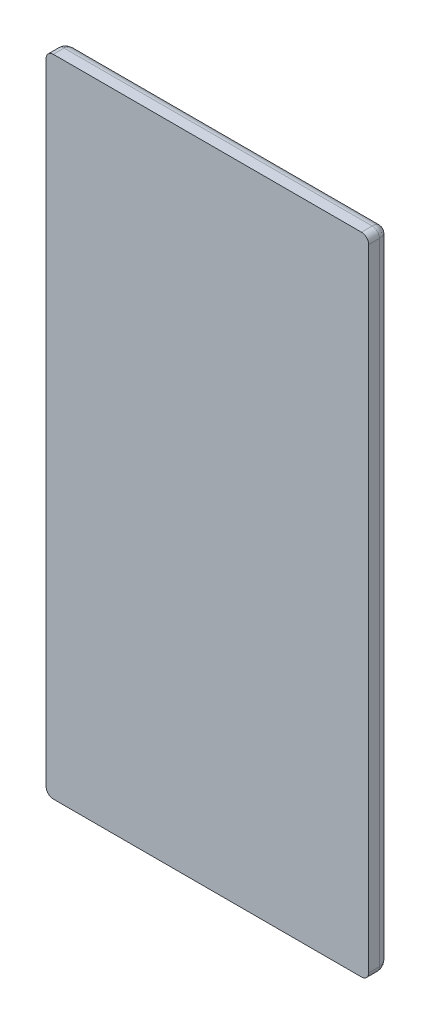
ISO-10303-21;
HEADER;
FILE_DESCRIPTION(('STEP AP214'),'2;1');
FILE_NAME('part.step','',(''),(''),'','','');
FILE_SCHEMA(('AUTOMOTIVE_DESIGN { 1 0 10303 214 1 1 1 1 }'));
ENDSEC;
DATA;
#1=APPLICATION_CONTEXT('core data for automotive mechanical design processes');
#2=APPLICATION_PROTOCOL_DEFINITION('international standard','automotive_design',2000,#1);
#3=PRODUCT_CONTEXT('',#1,'mechanical');
#4=PRODUCT('Part','Part','',(#3));
#5=PRODUCT_RELATED_PRODUCT_CATEGORY('part','',(#4));
#6=PRODUCT_DEFINITION_FORMATION('','',#4);
#7=PRODUCT_DEFINITION_CONTEXT('part definition',#1,'design');
#8=PRODUCT_DEFINITION('design','',#6,#7);
#9=PRODUCT_DEFINITION_SHAPE('','',#8);
#10=(LENGTH_UNIT() NAMED_UNIT(*) SI_UNIT(.MILLI.,.METRE.));
#11=(NAMED_UNIT(*) PLANE_ANGLE_UNIT() SI_UNIT($,.RADIAN.));
#12=(NAMED_UNIT(*) SI_UNIT($,.STERADIAN.) SOLID_ANGLE_UNIT());
#13=UNCERTAINTY_MEASURE_WITH_UNIT(LENGTH_MEASURE(1.E-05),#10,'distance_accuracy_value','');
#14=(GEOMETRIC_REPRESENTATION_CONTEXT(3) GLOBAL_UNCERTAINTY_ASSIGNED_CONTEXT((#13)) GLOBAL_UNIT_ASSIGNED_CONTEXT((#10,
#11,#12)) REPRESENTATION_CONTEXT('',''));
#15=CARTESIAN_POINT('',(0.,0.,0.));
#16=DIRECTION('',(0.,0.,1.));
#17=DIRECTION('',(1.,0.,0.));
#18=AXIS2_PLACEMENT_3D('',#15,#16,#17);
#19=CARTESIAN_POINT('',(21.5,-45.,1.5));
#20=CARTESIAN_POINT('',(21.6495996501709,-45.,1.5));
#21=CARTESIAN_POINT('',(21.8738186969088,-44.9486387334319,1.5));
#22=CARTESIAN_POINT('',(22.1286999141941,-44.7883214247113,1.5));
#23=CARTESIAN_POINT('',(22.3150622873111,-44.602148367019,1.5));
#24=CARTESIAN_POINT('',(22.4618750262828,-44.3365622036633,1.5));
#25=CARTESIAN_POINT('',(22.5,-44.1121997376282,1.5));
#26=CARTESIAN_POINT('',(22.5,-44.,1.5));
#27=CARTESIAN_POINT('',(21.5,-45.,1.38780026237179));
#28=CARTESIAN_POINT('',(21.6495996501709,-45.,1.3765841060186));
#29=CARTESIAN_POINT('',(21.8738186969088,-44.9486387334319,1.36367785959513));
#30=CARTESIAN_POINT('',(22.1286999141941,-44.7883214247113,1.35659921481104));
#31=CARTESIAN_POINT('',(22.3150622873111,-44.602148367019,1.3565890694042));
#32=CARTESIAN_POINT('',(22.4618750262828,-44.3365622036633,1.36547389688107));
#33=CARTESIAN_POINT('',(22.5,-44.1121997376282,1.37940644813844));
#34=CARTESIAN_POINT('',(22.5,-44.,1.38780026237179));
#35=CARTESIAN_POINT('',(21.4915873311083,-44.9747619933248,1.16338370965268));
#36=CARTESIAN_POINT('',(21.6351543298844,-44.969287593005,1.12990052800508));
#37=CARTESIAN_POINT('',(21.8503425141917,-44.9129510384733,1.09140205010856));
#38=CARTESIAN_POINT('',(22.0969939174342,-44.7530973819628,1.07030167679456));
#39=CARTESIAN_POINT('',(22.2792299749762,-44.5710223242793,1.0702707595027));
#40=CARTESIAN_POINT('',(22.4266897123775,-44.3145760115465,1.09675512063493));
#41=CARTESIAN_POINT('',(22.4706410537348,-44.0992592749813,1.13831989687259));
#42=CARTESIAN_POINT('',(22.4747619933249,-43.9915873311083,1.16338370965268));
#43=CARTESIAN_POINT('',(21.4542722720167,-44.8628168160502,0.843752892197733));
#44=CARTESIAN_POINT('',(21.5757425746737,-44.8396615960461,0.79317328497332));
#45=CARTESIAN_POINT('',(21.7578957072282,-44.7691086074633,0.735820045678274));
#46=CARTESIAN_POINT('',(21.9731092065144,-44.6144834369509,0.704552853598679));
#47=CARTESIAN_POINT('',(22.138128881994,-44.4495697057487,0.704515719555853));
#48=CARTESIAN_POINT('',(22.2840790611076,-44.2275872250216,0.743730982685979));
#49=CARTESIAN_POINT('',(22.3454981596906,-44.0453899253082,0.8058786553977));
#50=CARTESIAN_POINT('',(22.3628168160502,-43.9542722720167,0.843752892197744));
#51=CARTESIAN_POINT('',(21.3742564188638,-44.6227692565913,0.46114030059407));
#52=CARTESIAN_POINT('',(21.4596880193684,-44.5786691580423,0.413716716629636));
#53=CARTESIAN_POINT('',(21.5878722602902,-44.4960532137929,0.361354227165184));
#54=CARTESIAN_POINT('',(21.7480550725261,-44.3602424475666,0.333106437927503));
#55=CARTESIAN_POINT('',(21.8789785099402,-44.2293577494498,0.3330875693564));
#56=CARTESIAN_POINT('',(22.0112784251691,-44.0665124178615,0.368462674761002));
#57=CARTESIAN_POINT('',(22.089778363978,-43.9383537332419,0.425600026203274));
#58=CARTESIAN_POINT('',(22.1227692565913,-43.8742564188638,0.46114030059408));
#59=CARTESIAN_POINT('',(21.224383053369,-44.1731491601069,0.102456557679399));
#60=CARTESIAN_POINT('',(21.2669279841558,-44.1301646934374,0.088221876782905));
#61=CARTESIAN_POINT('',(21.3307833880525,-44.0658665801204,0.073209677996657));
#62=CARTESIAN_POINT('',(21.4161010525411,-43.9801943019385,0.065260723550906));
#63=CARTESIAN_POINT('',(21.4908951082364,-43.9054155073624,0.065262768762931));
#64=CARTESIAN_POINT('',(21.5765989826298,-43.8201368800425,0.075189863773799));
#65=CARTESIAN_POINT('',(21.6409777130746,-43.7563091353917,0.091771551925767));
#66=CARTESIAN_POINT('',(21.6731491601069,-43.724383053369,0.102456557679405));
#67=CARTESIAN_POINT('',(21.0747998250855,-43.7243994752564,0.));
#68=CARTESIAN_POINT('',(21.089047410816,-43.7101518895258,0.));
#69=CARTESIAN_POINT('',(21.1104187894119,-43.68878051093,0.));
#70=CARTESIAN_POINT('',(21.138913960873,-43.6602853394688,0.));
#71=CARTESIAN_POINT('',(21.1638472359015,-43.6353520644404,0.));
#72=CARTESIAN_POINT('',(21.1923424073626,-43.6068568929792,0.));
#73=CARTESIAN_POINT('',(21.2137137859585,-43.5854855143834,0.));
#74=CARTESIAN_POINT('',(21.2243994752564,-43.5747998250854,0.));
#75=CARTESIAN_POINT('',(21.,-43.5,0.));
#76=CARTESIAN_POINT('',(21.,-43.5,0.));
#77=CARTESIAN_POINT('',(21.,-43.5,0.));
#78=CARTESIAN_POINT('',(21.,-43.5,0.));
#79=CARTESIAN_POINT('',(21.,-43.5,0.));
#80=CARTESIAN_POINT('',(21.,-43.5,0.));
#81=CARTESIAN_POINT('',(21.,-43.5,0.));
#82=CARTESIAN_POINT('',(21.,-43.5,0.));
#83=B_SPLINE_SURFACE_WITH_KNOTS('',3,3,((#19,#20,#21,#22,#23,#24,#25,#26),(#27,#28,#29,#30,#31,
#32,#33,#34),(#35,#36,#37,#38,#39,#40,#41,#42),(#43,#44,#45,#46,#47,#48,#49,#50),(#51,#52,#53,
#54,#55,#56,#57,#58),(#59,#60,#61,#62,#63,#64,#65,#66),(#67,#68,#69,#70,#71,#72,#73,#74),(#75,
#76,#77,#78,#79,#80,#81,#82)),.UNSPECIFIED.,.F.,.F.,.F.,(4,1,1,1,1,4),(4,1,1,1,1,4),(0.,
0.224399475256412,0.448798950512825,0.673198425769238,1.12199737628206,1.57079632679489),(0.,
0.285714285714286,0.428571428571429,0.571428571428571,0.785714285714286,1.),.UNSPECIFIED.);
#84=CARTESIAN_POINT('',(21.,-43.5,0.));
#85=CARTESIAN_POINT('',(21.2243994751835,-43.5747998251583,0.));
#86=CARTESIAN_POINT('',(21.6731491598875,-43.7243830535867,0.102456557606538));
#87=CARTESIAN_POINT('',(22.1227692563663,-43.8742564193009,0.461140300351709));
#88=CARTESIAN_POINT('',(22.3628168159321,-43.9542722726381,0.843752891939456));
#89=CARTESIAN_POINT('',(22.4747619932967,-43.9915873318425,1.16338370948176));
#90=CARTESIAN_POINT('',(22.5,-44.0000000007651,1.38780026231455));
#91=CARTESIAN_POINT('',(22.5,-44.0000000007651,1.5));
#92=B_SPLINE_CURVE_WITH_KNOTS('',3,(#84,#85,#86,#87,#88,#89,#90,#91),.UNSPECIFIED.,.F.,.F.,(4,1,
1,1,1,4),(0.,0.448798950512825,0.89759790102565,1.12199737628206,1.34639685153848,
1.57079632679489),.UNSPECIFIED.);
#93=CARTESIAN_POINT('',(22.5,-44.0000000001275,1.5));
#94=VERTEX_POINT('',#93);
#95=CARTESIAN_POINT('',(21.,-43.5,0.));
#96=VERTEX_POINT('',#95);
#97=EDGE_CURVE('E113',#94,#96,#92,.F.);
#98=CARTESIAN_POINT('',(22.5,-44.,1.5));
#99=CARTESIAN_POINT('',(22.5000000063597,-44.0130898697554,1.5));
#100=CARTESIAN_POINT('',(22.4997405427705,-44.0261796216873,1.5));
#101=CARTESIAN_POINT('',(22.4987060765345,-44.0523386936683,1.5));
#102=CARTESIAN_POINT('',(22.4979310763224,-44.0654080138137,1.5));
#103=CARTESIAN_POINT('',(22.4958689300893,-44.0915062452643,1.5));
#104=CARTESIAN_POINT('',(22.4945817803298,-44.1045351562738,1.5));
#105=CARTESIAN_POINT('',(22.4914987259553,-44.1305326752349,1.5));
#106=CARTESIAN_POINT('',(22.4897028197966,-44.1435012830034,1.5));
#107=CARTESIAN_POINT('',(22.4856056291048,-44.1693582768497,1.5));
#108=CARTESIAN_POINT('',(22.48330434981,-44.1822466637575,1.5));
#109=CARTESIAN_POINT('',(22.4781997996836,-44.2079233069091,1.5));
#110=CARTESIAN_POINT('',(22.475396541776,-44.220711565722,1.5));
#111=CARTESIAN_POINT('',(22.4692913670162,-44.2461680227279,1.5));
#112=CARTESIAN_POINT('',(22.4659894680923,-44.2588362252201,1.5));
#113=CARTESIAN_POINT('',(22.4588905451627,-44.2840327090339,1.5));
#114=CARTESIAN_POINT('',(22.4550935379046,-44.2965609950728,1.5));
#115=CARTESIAN_POINT('',(22.447007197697,-44.3214575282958,1.5));
#116=CARTESIAN_POINT('',(22.4427178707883,-44.3338257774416,1.5));
#117=CARTESIAN_POINT('',(22.4336530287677,-44.3583831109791,1.5));
#118=CARTESIAN_POINT('',(22.4288775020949,-44.3705721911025,1.5));
#119=CARTESIAN_POINT('',(22.4188508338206,-44.3947536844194,1.5));
#120=CARTESIAN_POINT('',(22.4135996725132,-44.4067460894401,1.5));
#121=CARTESIAN_POINT('',(22.4026314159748,-44.4305164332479,1.5));
#122=CARTESIAN_POINT('',(22.3969143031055,-44.4422943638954,1.5));
#123=CARTESIAN_POINT('',(22.3850240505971,-44.4656180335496,1.5));
#124=CARTESIAN_POINT('',(22.3788509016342,-44.4771637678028,1.5));
#125=CARTESIAN_POINT('',(22.3660584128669,-44.5000052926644,1.5));
#126=CARTESIAN_POINT('',(22.3594390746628,-44.5113010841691,1.5));
#127=CARTESIAN_POINT('',(22.3457640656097,-44.5336249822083,1.5));
#128=CARTESIAN_POINT('',(22.338708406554,-44.5446530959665,1.5));
#129=CARTESIAN_POINT('',(22.3241705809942,-44.5664238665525,1.5));
#130=CARTESIAN_POINT('',(22.3166884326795,-44.5771665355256,1.5));
#131=CARTESIAN_POINT('',(22.3013075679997,-44.5983487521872,1.5));
#132=CARTESIAN_POINT('',(22.2934088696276,-44.6087883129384,1.5));
#133=CARTESIAN_POINT('',(22.277204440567,-44.6293462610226,1.5));
#134=CARTESIAN_POINT('',(22.2688987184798,-44.639464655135,1.5));
#135=CARTESIAN_POINT('',(22.2518945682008,-44.6593660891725,1.5));
#136=CARTESIAN_POINT('',(22.2431961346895,-44.6691491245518,1.5));
#137=CARTESIAN_POINT('',(22.2254214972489,-44.6883663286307,1.5));
#138=CARTESIAN_POINT('',(22.2163452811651,-44.6978004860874,1.5));
#139=CARTESIAN_POINT('',(22.1978298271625,-44.7163062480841,1.5));
#140=CARTESIAN_POINT('',(22.1883905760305,-44.7253778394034,1.5));
#141=CARTESIAN_POINT('',(22.169163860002,-44.7431448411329,1.5));
#142=CARTESIAN_POINT('',(22.1593763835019,-44.751840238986,1.5));
#143=CARTESIAN_POINT('',(22.1394679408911,-44.7688411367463,1.5));
#144=CARTESIAN_POINT('',(22.1293469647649,-44.7771466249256,1.5));
#145=CARTESIAN_POINT('',(22.1087865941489,-44.7933542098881,1.5));
#146=CARTESIAN_POINT('',(22.098347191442,-44.8012562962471,1.5));
#147=CARTESIAN_POINT('',(22.0771668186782,-44.8166454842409,1.5));
#148=CARTESIAN_POINT('',(22.0664258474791,-44.8241325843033,1.5));
#149=CARTESIAN_POINT('',(22.044659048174,-44.8386800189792,1.5));
#150=CARTESIAN_POINT('',(22.0336332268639,-44.8457403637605,1.5));
#151=CARTESIAN_POINT('',(22.0113134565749,-44.8594224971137,1.5));
#152=CARTESIAN_POINT('',(22.0000195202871,-44.8660443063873,1.5));
#153=CARTESIAN_POINT('',(21.9771803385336,-44.8788377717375,1.5));
#154=CARTESIAN_POINT('',(21.9656351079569,-44.8850094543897,1.5));
#155=CARTESIAN_POINT('',(21.9423097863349,-44.8968903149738,1.5));
#156=CARTESIAN_POINT('',(21.9305297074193,-44.9025995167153,1.5));
#157=CARTESIAN_POINT('',(21.9067527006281,-44.9135464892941,1.5));
#158=CARTESIAN_POINT('',(21.8947557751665,-44.9187842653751,1.5));
#159=CARTESIAN_POINT('',(21.8705649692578,-44.9287842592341,1.5));
#160=CARTESIAN_POINT('',(21.8583710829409,-44.9335464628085,1.5));
#161=CARTESIAN_POINT('',(21.8338057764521,-44.9425902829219,1.5));
#162=CARTESIAN_POINT('',(21.8214343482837,-44.9468718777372,1.5));
#163=CARTESIAN_POINT('',(21.7965334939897,-44.9549496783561,1.5));
#164=CARTESIAN_POINT('',(21.7840040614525,-44.9587458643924,1.5));
#165=CARTESIAN_POINT('',(21.7588066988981,-44.9658479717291,1.5));
#166=CARTESIAN_POINT('',(21.7461387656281,-44.9691538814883,1.5));
#167=CARTESIAN_POINT('',(21.7206839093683,-44.9752705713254,1.5));
#168=CARTESIAN_POINT('',(21.707896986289,-44.9780813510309,1.5));
#169=CARTESIAN_POINT('',(21.6822236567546,-44.9832029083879,1.5));
#170=CARTESIAN_POINT('',(21.6693372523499,-44.9855136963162,1.5));
#171=CARTESIAN_POINT('',(21.6434844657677,-44.9896303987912,1.5));
#172=CARTESIAN_POINT('',(21.6305180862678,-44.9914363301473,1.5));
#173=CARTESIAN_POINT('',(21.6045248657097,-44.9945384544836,1.5));
#174=CARTESIAN_POINT('',(21.5914980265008,-44.995834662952,1.5));
#175=CARTESIAN_POINT('',(21.565403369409,-44.997912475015,1.5));
#176=CARTESIAN_POINT('',(21.5523355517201,-44.9986940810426,1.5));
#177=CARTESIAN_POINT('',(21.526178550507,-44.9997378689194,1.5));
#178=CARTESIAN_POINT('',(21.5130893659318,-45.000000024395,1.5));
#179=CARTESIAN_POINT('',(21.5,-45.,1.5));
#180=B_SPLINE_CURVE_WITH_KNOTS('',3,(#98,#99,#100,#101,#102,#103,#104,#105,#106,#107,#108,#109,
#110,#111,#112,#113,#114,#115,#116,#117,#118,#119,#120,#121,#122,#123,#124,#125,#126,#127,#128,
#129,#130,#131,#132,#133,#134,#135,#136,#137,#138,#139,#140,#141,#142,#143,#144,#145,#146,#147,
#148,#149,#150,#151,#152,#153,#154,#155,#156,#157,#158,#159,#160,#161,#162,#163,#164,#165,#166,
#167,#168,#169,#170,#171,#172,#173,#174,#175,#176,#177,#178,#179),.UNSPECIFIED.,.F.,.F.,(4,2,2,
2,2,2,2,2,2,2,2,2,2,2,2,2,2,2,2,2,2,2,2,2,2,2,2,2,2,2,2,2,2,2,2,2,2,2,2,2,4),(0.,
0.0392668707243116,0.0785335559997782,0.11780052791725,0.157067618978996,0.196334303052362,
0.235599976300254,0.27486423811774,0.314127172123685,0.353389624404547,0.392653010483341,
0.43191802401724,0.471184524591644,0.510451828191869,0.549718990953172,0.588985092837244,
0.628249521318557,0.667512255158,0.706774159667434,0.74603659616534,0.785300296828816,
0.824565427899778,0.86383186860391,0.903099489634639,0.942368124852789,0.981636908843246,
1.02090475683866,1.06017074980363,1.09943442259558,1.13869607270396,1.17795728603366,
1.21721967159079,1.25648383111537,1.29574958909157,1.33501627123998,1.37428298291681,
1.4135488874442,1.45281348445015,1.49207688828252,1.53134010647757,1.57060531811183),.UNSPECIFIED.);
#181=CARTESIAN_POINT('',(21.5,-45.,1.5));
#182=VERTEX_POINT('',#181);
#183=EDGE_CURVE('E96',#94,#182,#180,.T.);
#184=CARTESIAN_POINT('',(21.5,-45.,1.5));
#185=CARTESIAN_POINT('',(21.5000000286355,-45.0000000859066,1.48036418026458));
#186=CARTESIAN_POINT('',(21.499871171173,-44.9996135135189,1.46072847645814));
#187=CARTESIAN_POINT('',(21.4993568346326,-44.9980705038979,1.42148698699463));
#188=CARTESIAN_POINT('',(21.4989713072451,-44.9969139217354,1.40188120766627));
#189=CARTESIAN_POINT('',(21.4979446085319,-44.9938338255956,1.36273004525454));
#190=CARTESIAN_POINT('',(21.497303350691,-44.9919100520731,1.34318468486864));
#191=CARTESIAN_POINT('',(21.4957661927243,-44.9872985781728,1.30418475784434));
#192=CARTESIAN_POINT('',(21.4948701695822,-44.9846105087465,1.28473023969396));
#193=CARTESIAN_POINT('',(21.4928245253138,-44.9784735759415,1.24594237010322));
#194=CARTESIAN_POINT('',(21.4916747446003,-44.9750242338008,1.22660910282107));
#195=CARTESIAN_POINT('',(21.4891224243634,-44.9673672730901,1.18809423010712));
#196=CARTESIAN_POINT('',(21.4877196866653,-44.963159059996,1.16891275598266));
#197=CARTESIAN_POINT('',(21.4846631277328,-44.9539893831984,1.13073133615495));
#198=CARTESIAN_POINT('',(21.4830090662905,-44.9490271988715,1.11173158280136));
#199=CARTESIAN_POINT('',(21.4794537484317,-44.9383612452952,1.07394138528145));
#200=CARTESIAN_POINT('',(21.4775522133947,-44.9326566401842,1.05515120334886));
#201=CARTESIAN_POINT('',(21.4735054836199,-44.9205164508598,1.01780810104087));
#202=CARTESIAN_POINT('',(21.4713599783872,-44.9140799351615,0.99925551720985));
#203=CARTESIAN_POINT('',(21.46682891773,-44.9004867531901,0.962415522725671));
#204=CARTESIAN_POINT('',(21.4644430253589,-44.8933290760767,0.944128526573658));
#205=CARTESIAN_POINT('',(21.459434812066,-44.878304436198,0.907847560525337));
#206=CARTESIAN_POINT('',(21.4568121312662,-44.8704363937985,0.889854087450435));
#207=CARTESIAN_POINT('',(21.4513338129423,-44.854001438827,0.85418830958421));
#208=CARTESIAN_POINT('',(21.4484777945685,-44.8454333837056,0.836516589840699));
#209=CARTESIAN_POINT('',(21.4425371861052,-44.8276115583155,0.801521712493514));
#210=CARTESIAN_POINT('',(21.4394522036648,-44.8183566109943,0.784199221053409));
#211=CARTESIAN_POINT('',(21.4330586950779,-44.7991760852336,0.74992960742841));
#212=CARTESIAN_POINT('',(21.429749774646,-44.7892493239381,0.732983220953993));
#213=CARTESIAN_POINT('',(21.4229132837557,-44.768739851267,0.699492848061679));
#214=CARTESIAN_POINT('',(21.4193853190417,-44.7581559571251,0.682949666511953));
#215=CARTESIAN_POINT('',(21.4121156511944,-44.736346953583,0.65029273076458));
#216=CARTESIAN_POINT('',(21.408373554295,-44.725120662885,0.634179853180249));
#217=CARTESIAN_POINT('',(21.400680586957,-44.7020417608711,0.602410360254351));
#218=CARTESIAN_POINT('',(21.3967293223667,-44.6901879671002,0.586754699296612));
#219=CARTESIAN_POINT('',(21.388622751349,-44.665868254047,0.555927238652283));
#220=CARTESIAN_POINT('',(21.3844670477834,-44.6534011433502,0.540756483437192));
#221=CARTESIAN_POINT('',(21.3759591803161,-44.6278775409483,0.510918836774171));
#222=CARTESIAN_POINT('',(21.3716066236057,-44.6148198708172,0.496253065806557));
#223=CARTESIAN_POINT('',(21.3627129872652,-44.5881389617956,0.467444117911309));
#224=CARTESIAN_POINT('',(21.3581715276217,-44.574514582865,0.453302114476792));
#225=CARTESIAN_POINT('',(21.3489079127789,-44.5467237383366,0.425559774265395));
#226=CARTESIAN_POINT('',(21.3441853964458,-44.5325561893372,0.41196064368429));
#227=CARTESIAN_POINT('',(21.3345675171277,-44.5037025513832,0.385323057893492));
#228=CARTESIAN_POINT('',(21.3296718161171,-44.4890154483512,0.372285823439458));
#229=CARTESIAN_POINT('',(21.3197154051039,-44.4591462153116,0.34679108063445));
#230=CARTESIAN_POINT('',(21.3146543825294,-44.4439631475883,0.334334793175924));
#231=CARTESIAN_POINT('',(21.3043751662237,-44.4131254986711,0.310021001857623));
#232=CARTESIAN_POINT('',(21.2991566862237,-44.3974700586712,0.298164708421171));
#233=CARTESIAN_POINT('',(21.2885703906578,-44.3657111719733,0.275069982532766));
#234=CARTESIAN_POINT('',(21.2832023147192,-44.3496069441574,0.263832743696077));
#235=CARTESIAN_POINT('',(21.2723246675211,-44.3169740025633,0.241995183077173));
#236=CARTESIAN_POINT('',(21.2668148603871,-44.3004445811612,0.231396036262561));
#237=CARTESIAN_POINT('',(21.2556615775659,-44.2669847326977,0.210853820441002));
#238=CARTESIAN_POINT('',(21.2500178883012,-44.2500536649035,0.200911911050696));
#239=CARTESIAN_POINT('',(21.2386047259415,-44.2158141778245,0.181702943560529));
#240=CARTESIAN_POINT('',(21.2328350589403,-44.198505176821,0.172437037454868));
#241=CARTESIAN_POINT('',(21.2211776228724,-44.1635328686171,0.154600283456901));
#242=CARTESIAN_POINT('',(21.2152896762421,-44.1458690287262,0.146030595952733));
#243=CARTESIAN_POINT('',(21.2034044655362,-44.1102133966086,0.129600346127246));
#244=CARTESIAN_POINT('',(21.1974070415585,-44.0922211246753,0.121740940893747));
#245=CARTESIAN_POINT('',(21.1853129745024,-44.0559389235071,0.106736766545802));
#246=CARTESIAN_POINT('',(21.1792161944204,-44.0376485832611,0.0995931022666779));
#247=CARTESIAN_POINT('',(21.1669332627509,-44.0007997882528,0.0860276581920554));
#248=CARTESIAN_POINT('',(21.1607469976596,-43.9822409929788,0.0796069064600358));
#249=CARTESIAN_POINT('',(21.1482950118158,-43.9448850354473,0.0674941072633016));
#250=CARTESIAN_POINT('',(21.1420292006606,-43.9260876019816,0.0618029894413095));
#251=CARTESIAN_POINT('',(21.1294280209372,-43.8882840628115,0.0511564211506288));
#252=CARTESIAN_POINT('',(21.1230925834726,-43.8692777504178,0.0462017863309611));
#253=CARTESIAN_POINT('',(21.1103620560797,-43.8310861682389,0.0370351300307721));
#254=CARTESIAN_POINT('',(21.1039669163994,-43.8119007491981,0.0328237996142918));
#255=CARTESIAN_POINT('',(21.0911268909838,-43.7733806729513,0.025150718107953));
#256=CARTESIAN_POINT('',(21.0846819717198,-43.7540459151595,0.0216895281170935));
#257=CARTESIAN_POINT('',(21.0717522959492,-43.7152568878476,0.0155236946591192));
#258=CARTESIAN_POINT('',(21.06526751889,-43.6958025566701,0.0128194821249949));
#259=CARTESIAN_POINT('',(21.0522680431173,-43.6568041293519,0.00817457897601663));
#260=CARTESIAN_POINT('',(21.0457533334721,-43.6372600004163,0.00623419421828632));
#261=CARTESIAN_POINT('',(21.032703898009,-43.598111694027,0.00312388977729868));
#262=CARTESIAN_POINT('',(21.0261691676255,-43.5785075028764,0.00195416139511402));
#263=CARTESIAN_POINT('',(21.0130896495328,-43.5392689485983,0.000392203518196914));
#264=CARTESIAN_POINT('',(21.0065448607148,-43.5196345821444,6.69760596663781E-08));
#265=CARTESIAN_POINT('',(21.,-43.5,0.));
#266=B_SPLINE_CURVE_WITH_KNOTS('',3,(#184,#185,#186,#187,#188,#189,#190,#191,#192,#193,#194,
#195,#196,#197,#198,#199,#200,#201,#202,#203,#204,#205,#206,#207,#208,#209,#210,#211,#212,#213,
#214,#215,#216,#217,#218,#219,#220,#221,#222,#223,#224,#225,#226,#227,#228,#229,#230,#231,#232,
#233,#234,#235,#236,#237,#238,#239,#240,#241,#242,#243,#244,#245,#246,#247,#248,#249,#250,#251,
#252,#253,#254,#255,#256,#257,#258,#259,#260,#261,#262,#263,#264,#265),.UNSPECIFIED.,.F.,.F.,(4,
2,2,2,2,2,2,2,2,2,2,2,2,2,2,2,2,2,2,2,2,2,2,2,2,2,2,2,2,2,2,2,2,2,2,2,2,2,2,2,4),(0.,
0.0589030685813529,0.117817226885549,0.176751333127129,0.235713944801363,0.294713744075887,
0.353759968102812,0.41286298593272,0.472033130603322,0.531279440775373,0.590609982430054,
0.650032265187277,0.709553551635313,0.769179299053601,0.828912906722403,0.888757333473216,
0.948715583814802,1.00879114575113,1.06898841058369,1.12931160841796,1.18976265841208,
1.25034129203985,1.31104550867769,1.37187202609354,1.43281672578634,1.49387509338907,
1.55504265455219,1.61631540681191,1.67769024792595,1.73916536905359,1.80073889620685,
1.86240605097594,1.92415982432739,1.9859915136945,2.04789117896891,2.10984809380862,
2.17185119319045,2.23388951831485,2.29595266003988,2.35803120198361,2.42011716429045),.UNSPECIFIED.);
#267=EDGE_CURVE('E117',#96,#182,#266,.F.);
#268=ORIENTED_EDGE('',*,*,#97,.F.);
#269=ORIENTED_EDGE('',*,*,#183,.T.);
#270=ORIENTED_EDGE('',*,*,#267,.F.);
#271=EDGE_LOOP('',(#268,#269,#270));
#272=FACE_BOUND('',#271,.T.);
#273=ADVANCED_FACE('F16',(#272),#83,.T.);
#274=CARTESIAN_POINT('',(22.5,44.,1.5));
#275=CARTESIAN_POINT('',(22.5,44.1495996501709,1.5));
#276=CARTESIAN_POINT('',(22.4486387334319,44.3738186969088,1.5));
#277=CARTESIAN_POINT('',(22.2883214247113,44.6286999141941,1.5));
#278=CARTESIAN_POINT('',(22.102148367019,44.8150622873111,1.5));
#279=CARTESIAN_POINT('',(21.8365622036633,44.9618750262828,1.5));
#280=CARTESIAN_POINT('',(21.6121997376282,45.,1.5));
#281=CARTESIAN_POINT('',(21.5,45.,1.5));
#282=CARTESIAN_POINT('',(22.5,44.,1.38780026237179));
#283=CARTESIAN_POINT('',(22.5,44.1495996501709,1.3765841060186));
#284=CARTESIAN_POINT('',(22.4486387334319,44.3738186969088,1.36367785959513));
#285=CARTESIAN_POINT('',(22.2883214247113,44.6286999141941,1.35659921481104));
#286=CARTESIAN_POINT('',(22.102148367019,44.8150622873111,1.3565890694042));
#287=CARTESIAN_POINT('',(21.8365622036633,44.9618750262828,1.36547389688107));
#288=CARTESIAN_POINT('',(21.6121997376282,45.,1.37940644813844));
#289=CARTESIAN_POINT('',(21.5,45.,1.38780026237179));
#290=CARTESIAN_POINT('',(22.4745884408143,43.9915294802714,1.1635417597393));
#291=CARTESIAN_POINT('',(22.469436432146,44.1352787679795,1.13007533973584));
#292=CARTESIAN_POINT('',(22.413444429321,44.350740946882,1.09154224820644));
#293=CARTESIAN_POINT('',(22.2537301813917,44.59759262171,1.07041027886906));
#294=CARTESIAN_POINT('',(22.0716155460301,44.7798699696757,1.07037891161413));
#295=CARTESIAN_POINT('',(21.8149292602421,44.9271409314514,1.09690475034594));
#296=CARTESIAN_POINT('',(21.5993388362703,44.9707115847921,1.13849238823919));
#297=CARTESIAN_POINT('',(21.4915294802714,44.9745884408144,1.16354175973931));
#298=CARTESIAN_POINT('',(22.325760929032,43.9419203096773,0.736971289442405));
#299=CARTESIAN_POINT('',(22.2962171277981,44.0557419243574,0.680636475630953));
#300=CARTESIAN_POINT('',(22.2204044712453,44.2264611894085,0.617015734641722));
#301=CARTESIAN_POINT('',(22.0673021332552,44.4308888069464,0.582385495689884));
#302=CARTESIAN_POINT('',(21.9081680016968,44.5901092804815,0.582347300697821));
#303=CARTESIAN_POINT('',(21.6980413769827,44.7358510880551,0.625770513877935));
#304=CARTESIAN_POINT('',(21.5273079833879,44.8036736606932,0.694783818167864));
#305=CARTESIAN_POINT('',(21.4419203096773,44.825760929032,0.736971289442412));
#306=CARTESIAN_POINT('',(22.0388414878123,43.8462804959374,0.377489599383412));
#307=CARTESIAN_POINT('',(21.9924894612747,43.922364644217,0.337545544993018));
#308=CARTESIAN_POINT('',(21.9109702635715,44.0365183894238,0.293818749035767));
#309=CARTESIAN_POINT('',(21.7838343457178,44.1810841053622,0.2703078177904));
#310=CARTESIAN_POINT('',(21.663958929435,44.3009851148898,0.270296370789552));
#311=CARTESIAN_POINT('',(21.5174948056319,44.4256109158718,0.299724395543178));
#312=CARTESIAN_POINT('',(21.4033603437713,44.504138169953,0.347547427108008));
#313=CARTESIAN_POINT('',(21.3462804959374,44.5388414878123,0.377489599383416));
#314=CARTESIAN_POINT('',(21.5605808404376,43.6868602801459,0.077179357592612));
#315=CARTESIAN_POINT('',(21.5254487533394,43.7226859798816,0.066454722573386));
#316=CARTESIAN_POINT('',(21.4725798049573,43.7764578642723,0.055007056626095));
#317=CARTESIAN_POINT('',(21.401462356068,43.8479729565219,0.048915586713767));
#318=CARTESIAN_POINT('',(21.3390555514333,43.9103956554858,0.048915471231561));
#319=CARTESIAN_POINT('',(21.267493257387,43.9814383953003,0.056528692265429));
#320=CARTESIAN_POINT('',(21.2137454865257,44.0342921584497,0.069131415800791));
#321=CARTESIAN_POINT('',(21.1868602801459,44.0605808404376,0.077179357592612));
#322=CARTESIAN_POINT('',(21.2243994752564,43.5747998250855,0.));
#323=CARTESIAN_POINT('',(21.2101518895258,43.589047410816,0.));
#324=CARTESIAN_POINT('',(21.18878051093,43.6104187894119,0.));
#325=CARTESIAN_POINT('',(21.1602853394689,43.638913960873,0.));
#326=CARTESIAN_POINT('',(21.1353520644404,43.6638472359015,0.));
#327=CARTESIAN_POINT('',(21.1068568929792,43.6923424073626,0.));
#328=CARTESIAN_POINT('',(21.0854855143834,43.7137137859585,0.));
#329=CARTESIAN_POINT('',(21.0747998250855,43.7243994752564,0.));
#330=CARTESIAN_POINT('',(21.,43.5,0.));
#331=CARTESIAN_POINT('',(21.,43.5,0.));
#332=CARTESIAN_POINT('',(21.,43.5,0.));
#333=CARTESIAN_POINT('',(21.,43.5,0.));
#334=CARTESIAN_POINT('',(21.,43.5,0.));
#335=CARTESIAN_POINT('',(21.,43.5,0.));
#336=CARTESIAN_POINT('',(21.,43.5,0.));
#337=CARTESIAN_POINT('',(21.,43.5,0.));
#338=B_SPLINE_SURFACE_WITH_KNOTS('',3,3,((#274,#275,#276,#277,#278,#279,#280,#281),(#282,#283,
#284,#285,#286,#287,#288,#289),(#290,#291,#292,#293,#294,#295,#296,#297),(#298,#299,#300,#301,
#302,#303,#304,#305),(#306,#307,#308,#309,#310,#311,#312,#313),(#314,#315,#316,#317,#318,#319,
#320,#321),(#322,#323,#324,#325,#326,#327,#328,#329),(#330,#331,#332,#333,#334,#335,#336,#337)),
.UNSPECIFIED.,.F.,.F.,.F.,(4,1,1,1,1,4),(4,1,1,1,1,4),(0.,0.224399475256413,0.448798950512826,
0.897597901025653,1.12199737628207,1.57079632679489),(0.,0.285714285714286,0.428571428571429,
0.571428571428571,0.785714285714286,1.),.UNSPECIFIED.);
#339=CARTESIAN_POINT('',(21.,43.5,0.));
#340=CARTESIAN_POINT('',(21.0747998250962,43.7243994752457,0.));
#341=CARTESIAN_POINT('',(21.1868602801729,44.0605808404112,0.0771793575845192));
#342=CARTESIAN_POINT('',(21.3462804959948,44.5388414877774,0.377489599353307));
#343=CARTESIAN_POINT('',(21.4419203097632,44.8257609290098,0.73697128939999));
#344=CARTESIAN_POINT('',(21.4915294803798,44.9745884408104,1.16354175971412));
#345=CARTESIAN_POINT('',(21.5000000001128,45.,1.38780026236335));
#346=CARTESIAN_POINT('',(21.5000000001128,45.,1.5));
#347=B_SPLINE_CURVE_WITH_KNOTS('',3,(#339,#340,#341,#342,#343,#344,#345,#346),.UNSPECIFIED.,.F.,
.F.,(4,1,1,1,1,4),(0.,0.448798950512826,0.673198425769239,1.12199737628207,1.34639685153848,
1.57079632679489),.UNSPECIFIED.);
#348=CARTESIAN_POINT('',(21.5000000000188,45.,1.5));
#349=VERTEX_POINT('',#348);
#350=CARTESIAN_POINT('',(21.,43.5,0.));
#351=VERTEX_POINT('',#350);
#352=EDGE_CURVE('E232',#349,#351,#347,.F.);
#353=CARTESIAN_POINT('',(21.5,45.,1.5));
#354=CARTESIAN_POINT('',(21.5130898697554,45.0000000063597,1.5));
#355=CARTESIAN_POINT('',(21.5261796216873,44.9997405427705,1.5));
#356=CARTESIAN_POINT('',(21.5523386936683,44.9987060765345,1.5));
#357=CARTESIAN_POINT('',(21.5654080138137,44.9979310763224,1.5));
#358=CARTESIAN_POINT('',(21.5915062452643,44.9958689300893,1.5));
#359=CARTESIAN_POINT('',(21.6045351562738,44.9945817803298,1.5));
#360=CARTESIAN_POINT('',(21.6305326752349,44.9914987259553,1.5));
#361=CARTESIAN_POINT('',(21.6435012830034,44.9897028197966,1.5));
#362=CARTESIAN_POINT('',(21.6693582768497,44.9856056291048,1.5));
#363=CARTESIAN_POINT('',(21.6822466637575,44.98330434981,1.5));
#364=CARTESIAN_POINT('',(21.7079233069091,44.9781997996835,1.5));
#365=CARTESIAN_POINT('',(21.720711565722,44.975396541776,1.5));
#366=CARTESIAN_POINT('',(21.7461680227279,44.9692913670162,1.5));
#367=CARTESIAN_POINT('',(21.7588362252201,44.9659894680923,1.5));
#368=CARTESIAN_POINT('',(21.7840327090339,44.9588905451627,1.5));
#369=CARTESIAN_POINT('',(21.7965609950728,44.9550935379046,1.5));
#370=CARTESIAN_POINT('',(21.8214575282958,44.947007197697,1.5));
#371=CARTESIAN_POINT('',(21.8338257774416,44.9427178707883,1.5));
#372=CARTESIAN_POINT('',(21.858383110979,44.9336530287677,1.5));
#373=CARTESIAN_POINT('',(21.8705721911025,44.9288775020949,1.5));
#374=CARTESIAN_POINT('',(21.8947536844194,44.9188508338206,1.5));
#375=CARTESIAN_POINT('',(21.9067460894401,44.9135996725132,1.5));
#376=CARTESIAN_POINT('',(21.9305164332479,44.9026314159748,1.5));
#377=CARTESIAN_POINT('',(21.9422943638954,44.8969143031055,1.5));
#378=CARTESIAN_POINT('',(21.9656180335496,44.885024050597,1.5));
#379=CARTESIAN_POINT('',(21.9771637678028,44.8788509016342,1.5));
#380=CARTESIAN_POINT('',(22.0000052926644,44.8660584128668,1.5));
#381=CARTESIAN_POINT('',(22.0113010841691,44.8594390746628,1.5));
#382=CARTESIAN_POINT('',(22.0336249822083,44.8457640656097,1.5));
#383=CARTESIAN_POINT('',(22.0446530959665,44.838708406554,1.5));
#384=CARTESIAN_POINT('',(22.0664238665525,44.8241705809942,1.5));
#385=CARTESIAN_POINT('',(22.0771665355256,44.8166884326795,1.5));
#386=CARTESIAN_POINT('',(22.0983487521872,44.8013075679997,1.5));
#387=CARTESIAN_POINT('',(22.1087883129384,44.7934088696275,1.5));
#388=CARTESIAN_POINT('',(22.1293462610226,44.777204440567,1.5));
#389=CARTESIAN_POINT('',(22.139464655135,44.7688987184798,1.5));
#390=CARTESIAN_POINT('',(22.1593660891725,44.7518945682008,1.5));
#391=CARTESIAN_POINT('',(22.1691491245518,44.7431961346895,1.5));
#392=CARTESIAN_POINT('',(22.1883663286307,44.7254214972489,1.5));
#393=CARTESIAN_POINT('',(22.1978004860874,44.7163452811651,1.5));
#394=CARTESIAN_POINT('',(22.2163062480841,44.6978298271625,1.5));
#395=CARTESIAN_POINT('',(22.2253778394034,44.6883905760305,1.5));
#396=CARTESIAN_POINT('',(22.2431448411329,44.669163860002,1.5));
#397=CARTESIAN_POINT('',(22.251840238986,44.6593763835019,1.5));
#398=CARTESIAN_POINT('',(22.2688411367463,44.6394679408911,1.5));
#399=CARTESIAN_POINT('',(22.2771466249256,44.6293469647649,1.5));
#400=CARTESIAN_POINT('',(22.2933542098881,44.608786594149,1.5));
#401=CARTESIAN_POINT('',(22.3012562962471,44.598347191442,1.5));
#402=CARTESIAN_POINT('',(22.3166454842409,44.5771668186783,1.5));
#403=CARTESIAN_POINT('',(22.3241325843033,44.5664258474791,1.5));
#404=CARTESIAN_POINT('',(22.3386800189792,44.544659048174,1.5));
#405=CARTESIAN_POINT('',(22.3457403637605,44.5336332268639,1.5));
#406=CARTESIAN_POINT('',(22.3594224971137,44.5113134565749,1.5));
#407=CARTESIAN_POINT('',(22.3660443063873,44.5000195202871,1.5));
#408=CARTESIAN_POINT('',(22.3788377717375,44.4771803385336,1.5));
#409=CARTESIAN_POINT('',(22.3850094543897,44.4656351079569,1.5));
#410=CARTESIAN_POINT('',(22.3968903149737,44.4423097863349,1.5));
#411=CARTESIAN_POINT('',(22.4025995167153,44.4305297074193,1.5));
#412=CARTESIAN_POINT('',(22.4135464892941,44.4067527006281,1.5));
#413=CARTESIAN_POINT('',(22.4187842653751,44.3947557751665,1.5));
#414=CARTESIAN_POINT('',(22.4287842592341,44.3705649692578,1.5));
#415=CARTESIAN_POINT('',(22.4335464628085,44.3583710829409,1.5));
#416=CARTESIAN_POINT('',(22.4425902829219,44.3338057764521,1.5));
#417=CARTESIAN_POINT('',(22.4468718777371,44.3214343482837,1.5));
#418=CARTESIAN_POINT('',(22.4549496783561,44.2965334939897,1.5));
#419=CARTESIAN_POINT('',(22.4587458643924,44.2840040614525,1.5));
#420=CARTESIAN_POINT('',(22.4658479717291,44.2588066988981,1.5));
#421=CARTESIAN_POINT('',(22.4691538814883,44.2461387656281,1.5));
#422=CARTESIAN_POINT('',(22.4752705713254,44.2206839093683,1.5));
#423=CARTESIAN_POINT('',(22.4780813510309,44.207896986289,1.5));
#424=CARTESIAN_POINT('',(22.483202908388,44.1822236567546,1.5));
#425=CARTESIAN_POINT('',(22.4855136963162,44.1693372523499,1.5));
#426=CARTESIAN_POINT('',(22.4896303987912,44.1434844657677,1.5));
#427=CARTESIAN_POINT('',(22.4914363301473,44.1305180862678,1.5));
#428=CARTESIAN_POINT('',(22.4945384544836,44.1045248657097,1.5));
#429=CARTESIAN_POINT('',(22.495834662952,44.0914980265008,1.5));
#430=CARTESIAN_POINT('',(22.497912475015,44.065403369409,1.5));
#431=CARTESIAN_POINT('',(22.4986940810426,44.05233555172,1.5));
#432=CARTESIAN_POINT('',(22.4997378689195,44.026178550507,1.5));
#433=CARTESIAN_POINT('',(22.500000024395,44.0130893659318,1.5));
#434=CARTESIAN_POINT('',(22.5,44.,1.5));
#435=B_SPLINE_CURVE_WITH_KNOTS('',3,(#353,#354,#355,#356,#357,#358,#359,#360,#361,#362,#363,
#364,#365,#366,#367,#368,#369,#370,#371,#372,#373,#374,#375,#376,#377,#378,#379,#380,#381,#382,
#383,#384,#385,#386,#387,#388,#389,#390,#391,#392,#393,#394,#395,#396,#397,#398,#399,#400,#401,
#402,#403,#404,#405,#406,#407,#408,#409,#410,#411,#412,#413,#414,#415,#416,#417,#418,#419,#420,
#421,#422,#423,#424,#425,#426,#427,#428,#429,#430,#431,#432,#433,#434),.UNSPECIFIED.,.F.,.F.,(4,
2,2,2,2,2,2,2,2,2,2,2,2,2,2,2,2,2,2,2,2,2,2,2,2,2,2,2,2,2,2,2,2,2,2,2,2,2,2,2,4),(0.,
0.0392668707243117,0.0785335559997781,0.117800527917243,0.157067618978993,0.196334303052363,
0.23559997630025,0.274864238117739,0.314127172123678,0.353389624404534,0.39265301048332,
0.431918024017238,0.471184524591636,0.510451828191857,0.549718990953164,0.588985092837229,
0.628249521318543,0.667512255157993,0.706774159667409,0.746036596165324,0.785300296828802,
0.824565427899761,0.863831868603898,0.903099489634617,0.942368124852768,0.981636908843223,
1.02090475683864,1.06017074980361,1.09943442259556,1.13869607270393,1.17795728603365,
1.21721967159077,1.25648383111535,1.29574958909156,1.33501627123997,1.37428298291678,
1.41354888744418,1.45281348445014,1.49207688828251,1.53134010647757,1.57060531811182),.UNSPECIFIED.);
#436=CARTESIAN_POINT('',(22.5,44.,1.5));
#437=VERTEX_POINT('',#436);
#438=EDGE_CURVE('E109',#349,#437,#435,.T.);
#439=CARTESIAN_POINT('',(22.5,44.,1.5));
#440=CARTESIAN_POINT('',(22.5000001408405,44.0000000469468,1.48036618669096));
#441=CARTESIAN_POINT('',(22.4996109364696,43.9998703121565,1.46073257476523));
#442=CARTESIAN_POINT('',(22.4980592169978,43.9993530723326,1.42149831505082));
#443=CARTESIAN_POINT('',(22.4968966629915,43.9989655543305,1.40189766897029));
#444=CARTESIAN_POINT('',(22.4938031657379,43.9979343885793,1.36275807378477));
#445=CARTESIAN_POINT('',(22.4918719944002,43.9972906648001,1.34321914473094));
#446=CARTESIAN_POINT('',(22.4872463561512,43.9957487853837,1.30423155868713));
#447=CARTESIAN_POINT('',(22.4845514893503,43.9948504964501,1.28478295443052));
#448=CARTESIAN_POINT('',(22.4784035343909,43.9928011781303,1.24600460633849));
#449=CARTESIAN_POINT('',(22.4749498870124,43.9916499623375,1.22667496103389));
#450=CARTESIAN_POINT('',(22.4672892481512,43.9890964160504,1.18816315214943));
#451=CARTESIAN_POINT('',(22.4630815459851,43.9876938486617,1.16898114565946));
#452=CARTESIAN_POINT('',(22.4539186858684,43.9846395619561,1.13079391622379));
#453=CARTESIAN_POINT('',(22.4489627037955,43.9829875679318,1.1117889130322));
#454=CARTESIAN_POINT('',(22.4383115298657,43.9794371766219,1.0739859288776));
#455=CARTESIAN_POINT('',(22.4326154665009,43.9775384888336,1.05518822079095));
#456=CARTESIAN_POINT('',(22.4204920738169,43.973497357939,1.01783027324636));
#457=CARTESIAN_POINT('',(22.4140638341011,43.971354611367,0.999270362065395));
#458=CARTESIAN_POINT('',(22.4004840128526,43.9668280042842,0.962418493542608));
#459=CARTESIAN_POINT('',(22.3933314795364,43.9644438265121,0.944126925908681));
#460=CARTESIAN_POINT('',(22.3783113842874,43.9594371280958,0.907841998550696));
#461=CARTESIAN_POINT('',(22.3704428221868,43.9568142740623,0.88984909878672));
#462=CARTESIAN_POINT('',(22.3539974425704,43.9513324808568,0.854192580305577));
#463=CARTESIAN_POINT('',(22.3454195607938,43.9484731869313,0.836529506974));
#464=CARTESIAN_POINT('',(22.3275701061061,43.9425233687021,0.801559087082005));
#465=CARTESIAN_POINT('',(22.3182973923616,43.9394324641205,0.784252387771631));
#466=CARTESIAN_POINT('',(22.2990783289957,43.9330261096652,0.750017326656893));
#467=CARTESIAN_POINT('',(22.2891307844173,43.9297102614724,0.733089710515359));
#468=CARTESIAN_POINT('',(22.2685807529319,43.9228602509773,0.699636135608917));
#469=CARTESIAN_POINT('',(22.2579770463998,43.9193256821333,0.683111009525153));
#470=CARTESIAN_POINT('',(22.2361337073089,43.912044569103,0.650485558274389));
#471=CARTESIAN_POINT('',(22.2248928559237,43.9082976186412,0.634386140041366));
#472=CARTESIAN_POINT('',(22.2017941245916,43.9005980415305,0.602635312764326));
#473=CARTESIAN_POINT('',(22.1899350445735,43.8966450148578,0.586984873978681));
#474=CARTESIAN_POINT('',(22.1656187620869,43.8885395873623,0.556155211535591));
#475=CARTESIAN_POINT('',(22.1531603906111,43.8843867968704,0.540977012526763));
#476=CARTESIAN_POINT('',(22.1276644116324,43.8758881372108,0.511115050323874));
#477=CARTESIAN_POINT('',(22.114625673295,43.8715418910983,0.49643236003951));
#478=CARTESIAN_POINT('',(22.0879878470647,43.8626626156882,0.467584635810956));
#479=CARTESIAN_POINT('',(22.0743876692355,43.8581292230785,0.453420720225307));
#480=CARTESIAN_POINT('',(22.0466458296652,43.8488819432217,0.425633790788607));
#481=CARTESIAN_POINT('',(22.0325031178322,43.8441677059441,0.412011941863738));
#482=CARTESIAN_POINT('',(22.0036951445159,43.834565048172,0.385332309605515));
#483=CARTESIAN_POINT('',(21.9890288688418,43.8296762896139,0.37227574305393));
#484=CARTESIAN_POINT('',(21.959192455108,43.8197308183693,0.346750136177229));
#485=CARTESIAN_POINT('',(21.9440213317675,43.8146737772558,0.334282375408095));
#486=CARTESIAN_POINT('',(21.913195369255,43.8043984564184,0.309957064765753));
#487=CARTESIAN_POINT('',(21.8975395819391,43.7991798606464,0.298100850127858));
#488=CARTESIAN_POINT('',(21.8657713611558,43.7885904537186,0.275014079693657));
#489=CARTESIAN_POINT('',(21.8496580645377,43.7832193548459,0.263784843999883));
#490=CARTESIAN_POINT('',(21.8170014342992,43.7723338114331,0.24196835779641));
#491=CARTESIAN_POINT('',(21.8004573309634,43.7668191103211,0.231382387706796));
#492=CARTESIAN_POINT('',(21.7669658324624,43.7556552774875,0.210868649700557));
#493=CARTESIAN_POINT('',(21.7500177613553,43.7500059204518,0.200942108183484));
#494=CARTESIAN_POINT('',(21.7157451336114,43.7385817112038,0.18176326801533));
#495=CARTESIAN_POINT('',(21.698419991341,43.7328066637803,0.172512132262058));
#496=CARTESIAN_POINT('',(21.663419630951,43.7211398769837,0.154701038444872));
#497=CARTESIAN_POINT('',(21.6457439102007,43.7152479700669,0.14614217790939));
#498=CARTESIAN_POINT('',(21.6100700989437,43.7033566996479,0.12972834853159));
#499=CARTESIAN_POINT('',(21.5920715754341,43.6973571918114,0.121874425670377));
#500=CARTESIAN_POINT('',(21.5557814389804,43.6852604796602,0.1068772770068));
#501=CARTESIAN_POINT('',(21.5374894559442,43.6791631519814,0.0997350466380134));
#502=CARTESIAN_POINT('',(21.5006411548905,43.6668803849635,0.086169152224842));
#503=CARTESIAN_POINT('',(21.4820845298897,43.6606948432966,0.0797464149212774));
#504=CARTESIAN_POINT('',(21.4447358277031,43.648245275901,0.0676271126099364));
#505=CARTESIAN_POINT('',(21.4259435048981,43.6419811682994,0.0619313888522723));
#506=CARTESIAN_POINT('',(21.3881522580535,43.6293840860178,0.0512738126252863));
#507=CARTESIAN_POINT('',(21.369153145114,43.6230510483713,0.0463127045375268));
#508=CARTESIAN_POINT('',(21.3309771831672,43.6103257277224,0.0371320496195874));
#509=CARTESIAN_POINT('',(21.3118001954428,43.6039333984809,0.0329131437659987));
#510=CARTESIAN_POINT('',(21.2732973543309,43.5910991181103,0.0252245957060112));
#511=CARTESIAN_POINT('',(21.2539714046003,43.5846571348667,0.0217554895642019));
#512=CARTESIAN_POINT('',(21.2151995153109,43.5717331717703,0.0155742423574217));
#513=CARTESIAN_POINT('',(21.1957535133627,43.5652511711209,0.0128625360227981));
#514=CARTESIAN_POINT('',(21.1567704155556,43.5522568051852,0.00820379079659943));
#515=CARTESIAN_POINT('',(21.1372332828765,43.5457444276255,0.0062570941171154));
#516=CARTESIAN_POINT('',(21.0980967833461,43.532698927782,0.00313604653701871));
#517=CARTESIAN_POINT('',(21.0784973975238,43.5261657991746,0.0019619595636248));
#518=CARTESIAN_POINT('',(21.0392654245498,43.5130884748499,0.00039385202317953));
#519=CARTESIAN_POINT('',(21.0196328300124,43.5065442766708,3.70119876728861E-08));
#520=CARTESIAN_POINT('',(21.,43.5,0.));
#521=B_SPLINE_CURVE_WITH_KNOTS('',3,(#439,#440,#441,#442,#443,#444,#445,#446,#447,#448,#449,
#450,#451,#452,#453,#454,#455,#456,#457,#458,#459,#460,#461,#462,#463,#464,#465,#466,#467,#468,
#469,#470,#471,#472,#473,#474,#475,#476,#477,#478,#479,#480,#481,#482,#483,#484,#485,#486,#487,
#488,#489,#490,#491,#492,#493,#494,#495,#496,#497,#498,#499,#500,#501,#502,#503,#504,#505,#506,
#507,#508,#509,#510,#511,#512,#513,#514,#515,#516,#517,#518,#519,#520),.UNSPECIFIED.,.F.,.F.,(4,
2,2,2,2,2,2,2,2,2,2,2,2,2,2,2,2,2,2,2,2,2,2,2,2,2,2,2,2,2,2,2,2,2,2,2,2,2,2,2,4),(0.,
0.058896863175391,0.117796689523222,0.176714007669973,0.235662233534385,0.294654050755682,
0.353701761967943,0.412814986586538,0.471998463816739,0.5312563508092,0.590593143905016,
0.650014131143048,0.709525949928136,0.769137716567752,0.82885794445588,0.888692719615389,
0.948646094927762,1.00872052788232,1.06891731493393,1.12923702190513,1.18967991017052,
1.250246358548,1.3109372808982,1.37175453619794,1.43269939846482,1.49376808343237,
1.55495459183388,1.61625188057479,1.6776523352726,1.73914829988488,1.80073405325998,
1.86240477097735,1.92415403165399,1.98597410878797,2.04785640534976,2.10979188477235,
2.17177149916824,2.23378661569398,2.29582944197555,2.35789345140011,2.41997380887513),.UNSPECIFIED.);
#522=EDGE_CURVE('E124',#351,#437,#521,.F.);
#523=ORIENTED_EDGE('',*,*,#352,.F.);
#524=ORIENTED_EDGE('',*,*,#438,.T.);
#525=ORIENTED_EDGE('',*,*,#522,.F.);
#526=EDGE_LOOP('',(#523,#524,#525));
#527=FACE_BOUND('',#526,.T.);
#528=ADVANCED_FACE('F332',(#527),#338,.T.);
#529=CARTESIAN_POINT('',(-21.5,45.,1.5));
#530=CARTESIAN_POINT('',(-21.6495996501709,45.,1.5));
#531=CARTESIAN_POINT('',(-21.8738186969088,44.9486387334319,1.5));
#532=CARTESIAN_POINT('',(-22.1286999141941,44.7883214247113,1.5));
#533=CARTESIAN_POINT('',(-22.3150622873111,44.602148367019,1.5));
#534=CARTESIAN_POINT('',(-22.4618750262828,44.3365622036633,1.5));
#535=CARTESIAN_POINT('',(-22.5,44.1121997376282,1.5));
#536=CARTESIAN_POINT('',(-22.5,44.,1.5));
#537=CARTESIAN_POINT('',(-21.5,45.,1.38780026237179));
#538=CARTESIAN_POINT('',(-21.6495996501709,45.,1.3765841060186));
#539=CARTESIAN_POINT('',(-21.8738186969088,44.9486387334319,1.36367785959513));
#540=CARTESIAN_POINT('',(-22.1286999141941,44.7883214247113,1.35659921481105));
#541=CARTESIAN_POINT('',(-22.3150622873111,44.602148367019,1.3565890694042));
#542=CARTESIAN_POINT('',(-22.4618750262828,44.3365622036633,1.36547389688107));
#543=CARTESIAN_POINT('',(-22.5,44.1121997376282,1.37940644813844));
#544=CARTESIAN_POINT('',(-22.5,44.,1.38780026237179));
#545=CARTESIAN_POINT('',(-21.4915873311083,44.9747619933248,1.16338370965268));
#546=CARTESIAN_POINT('',(-21.6351543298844,44.969287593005,1.12990052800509));
#547=CARTESIAN_POINT('',(-21.8503425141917,44.9129510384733,1.09140205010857));
#548=CARTESIAN_POINT('',(-22.0969939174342,44.7530973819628,1.07030167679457));
#549=CARTESIAN_POINT('',(-22.2792299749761,44.5710223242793,1.07027075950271));
#550=CARTESIAN_POINT('',(-22.4266897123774,44.3145760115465,1.09675512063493));
#551=CARTESIAN_POINT('',(-22.4706410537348,44.0992592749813,1.13831989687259));
#552=CARTESIAN_POINT('',(-22.4747619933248,43.9915873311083,1.16338370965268));
#553=CARTESIAN_POINT('',(-21.4542722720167,44.8628168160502,0.843752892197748));
#554=CARTESIAN_POINT('',(-21.5757425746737,44.8396615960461,0.793173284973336));
#555=CARTESIAN_POINT('',(-21.7578957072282,44.7691086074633,0.735820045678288));
#556=CARTESIAN_POINT('',(-21.9731092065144,44.6144834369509,0.704552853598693));
#557=CARTESIAN_POINT('',(-22.1381288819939,44.4495697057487,0.704515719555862));
#558=CARTESIAN_POINT('',(-22.2840790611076,44.2275872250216,0.743730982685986));
#559=CARTESIAN_POINT('',(-22.3454981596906,44.0453899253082,0.805878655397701));
#560=CARTESIAN_POINT('',(-22.3628168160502,43.9542722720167,0.843752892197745));
#561=CARTESIAN_POINT('',(-21.3742564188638,44.6227692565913,0.46114030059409));
#562=CARTESIAN_POINT('',(-21.4596880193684,44.5786691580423,0.413716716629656));
#563=CARTESIAN_POINT('',(-21.5878722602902,44.4960532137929,0.361354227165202));
#564=CARTESIAN_POINT('',(-21.7480550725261,44.3602424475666,0.33310643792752));
#565=CARTESIAN_POINT('',(-21.8789785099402,44.2293577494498,0.333087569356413));
#566=CARTESIAN_POINT('',(-22.011278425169,44.0665124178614,0.368462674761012));
#567=CARTESIAN_POINT('',(-22.089778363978,43.9383537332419,0.425600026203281));
#568=CARTESIAN_POINT('',(-22.1227692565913,43.8742564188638,0.461140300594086));
#569=CARTESIAN_POINT('',(-21.224383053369,44.1731491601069,0.102456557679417));
#570=CARTESIAN_POINT('',(-21.2669279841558,44.1301646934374,0.088221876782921));
#571=CARTESIAN_POINT('',(-21.3307833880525,44.0658665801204,0.073209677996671));
#572=CARTESIAN_POINT('',(-21.4161010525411,43.9801943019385,0.065260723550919));
#573=CARTESIAN_POINT('',(-21.4908951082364,43.9054155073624,0.065262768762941));
#574=CARTESIAN_POINT('',(-21.5765989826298,43.8201368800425,0.075189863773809));
#575=CARTESIAN_POINT('',(-21.6409777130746,43.7563091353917,0.091771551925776));
#576=CARTESIAN_POINT('',(-21.6731491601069,43.724383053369,0.102456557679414));
#577=CARTESIAN_POINT('',(-21.0747998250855,43.7243994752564,0.));
#578=CARTESIAN_POINT('',(-21.089047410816,43.7101518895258,0.));
#579=CARTESIAN_POINT('',(-21.1104187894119,43.68878051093,0.));
#580=CARTESIAN_POINT('',(-21.138913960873,43.6602853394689,0.));
#581=CARTESIAN_POINT('',(-21.1638472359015,43.6353520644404,0.));
#582=CARTESIAN_POINT('',(-21.1923424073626,43.6068568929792,0.));
#583=CARTESIAN_POINT('',(-21.2137137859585,43.5854855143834,0.));
#584=CARTESIAN_POINT('',(-21.2243994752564,43.5747998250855,0.));
#585=CARTESIAN_POINT('',(-21.,43.5,0.));
#586=CARTESIAN_POINT('',(-21.,43.5,0.));
#587=CARTESIAN_POINT('',(-21.,43.5,0.));
#588=CARTESIAN_POINT('',(-21.,43.5,0.));
#589=CARTESIAN_POINT('',(-21.,43.5,0.));
#590=CARTESIAN_POINT('',(-21.,43.5,0.));
#591=CARTESIAN_POINT('',(-21.,43.5,0.));
#592=CARTESIAN_POINT('',(-21.,43.5,0.));
#593=B_SPLINE_SURFACE_WITH_KNOTS('',3,3,((#529,#530,#531,#532,#533,#534,#535,#536),(#537,#538,
#539,#540,#541,#542,#543,#544),(#545,#546,#547,#548,#549,#550,#551,#552),(#553,#554,#555,#556,
#557,#558,#559,#560),(#561,#562,#563,#564,#565,#566,#567,#568),(#569,#570,#571,#572,#573,#574,
#575,#576),(#577,#578,#579,#580,#581,#582,#583,#584),(#585,#586,#587,#588,#589,#590,#591,#592)),
.UNSPECIFIED.,.F.,.F.,.F.,(4,1,1,1,1,4),(4,1,1,1,1,4),(0.,0.224399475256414,0.448798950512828,
0.673198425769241,1.12199737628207,1.5707963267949),(0.,0.285714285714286,0.428571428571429,
0.571428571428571,0.785714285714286,1.),.UNSPECIFIED.);
#594=CARTESIAN_POINT('',(-21.,43.5,0.));
#595=CARTESIAN_POINT('',(-21.2243994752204,43.5747998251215,0.));
#596=CARTESIAN_POINT('',(-21.6731491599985,43.7243830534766,0.10245655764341));
#597=CARTESIAN_POINT('',(-22.1227692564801,43.8742564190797,0.461140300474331));
#598=CARTESIAN_POINT('',(-22.3628168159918,43.9542722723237,0.843752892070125));
#599=CARTESIAN_POINT('',(-22.4747619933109,43.9915873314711,1.16338370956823));
#600=CARTESIAN_POINT('',(-22.5,44.0000000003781,1.38780026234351));
#601=CARTESIAN_POINT('',(-22.5,44.0000000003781,1.5));
#602=B_SPLINE_CURVE_WITH_KNOTS('',3,(#594,#595,#596,#597,#598,#599,#600,#601),.UNSPECIFIED.,.F.,
.F.,(4,1,1,1,1,4),(0.,0.448798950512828,0.897597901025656,1.12199737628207,1.34639685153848,
1.5707963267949),.UNSPECIFIED.);
#603=CARTESIAN_POINT('',(-22.5,44.000000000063,1.5));
#604=VERTEX_POINT('',#603);
#605=CARTESIAN_POINT('',(-21.,43.5,0.));
#606=VERTEX_POINT('',#605);
#607=EDGE_CURVE('E171',#604,#606,#602,.F.);
#608=CARTESIAN_POINT('',(-22.5,44.,1.5));
#609=CARTESIAN_POINT('',(-22.5000000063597,44.0130898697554,1.5));
#610=CARTESIAN_POINT('',(-22.4997405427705,44.0261796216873,1.5));
#611=CARTESIAN_POINT('',(-22.4987060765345,44.0523386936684,1.5));
#612=CARTESIAN_POINT('',(-22.4979310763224,44.0654080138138,1.5));
#613=CARTESIAN_POINT('',(-22.4958689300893,44.0915062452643,1.5));
#614=CARTESIAN_POINT('',(-22.4945817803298,44.1045351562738,1.5));
#615=CARTESIAN_POINT('',(-22.4914987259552,44.1305326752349,1.5));
#616=CARTESIAN_POINT('',(-22.4897028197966,44.1435012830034,1.5));
#617=CARTESIAN_POINT('',(-22.4856056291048,44.1693582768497,1.5));
#618=CARTESIAN_POINT('',(-22.48330434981,44.1822466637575,1.5));
#619=CARTESIAN_POINT('',(-22.4781997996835,44.2079233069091,1.5));
#620=CARTESIAN_POINT('',(-22.475396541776,44.220711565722,1.5));
#621=CARTESIAN_POINT('',(-22.4692913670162,44.2461680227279,1.5));
#622=CARTESIAN_POINT('',(-22.4659894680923,44.2588362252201,1.5));
#623=CARTESIAN_POINT('',(-22.4588905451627,44.2840327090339,1.5));
#624=CARTESIAN_POINT('',(-22.4550935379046,44.2965609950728,1.5));
#625=CARTESIAN_POINT('',(-22.447007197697,44.3214575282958,1.5));
#626=CARTESIAN_POINT('',(-22.4427178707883,44.3338257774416,1.5));
#627=CARTESIAN_POINT('',(-22.4336530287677,44.3583831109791,1.5));
#628=CARTESIAN_POINT('',(-22.4288775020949,44.3705721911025,1.5));
#629=CARTESIAN_POINT('',(-22.4188508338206,44.3947536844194,1.5));
#630=CARTESIAN_POINT('',(-22.4135996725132,44.4067460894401,1.5));
#631=CARTESIAN_POINT('',(-22.4026314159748,44.4305164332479,1.5));
#632=CARTESIAN_POINT('',(-22.3969143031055,44.4422943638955,1.5));
#633=CARTESIAN_POINT('',(-22.385024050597,44.4656180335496,1.5));
#634=CARTESIAN_POINT('',(-22.3788509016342,44.4771637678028,1.5));
#635=CARTESIAN_POINT('',(-22.3660584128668,44.5000052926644,1.5));
#636=CARTESIAN_POINT('',(-22.3594390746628,44.5113010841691,1.5));
#637=CARTESIAN_POINT('',(-22.3457640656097,44.5336249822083,1.5));
#638=CARTESIAN_POINT('',(-22.338708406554,44.5446530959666,1.5));
#639=CARTESIAN_POINT('',(-22.3241705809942,44.5664238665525,1.5));
#640=CARTESIAN_POINT('',(-22.3166884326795,44.5771665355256,1.5));
#641=CARTESIAN_POINT('',(-22.3013075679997,44.5983487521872,1.5));
#642=CARTESIAN_POINT('',(-22.2934088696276,44.6087883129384,1.5));
#643=CARTESIAN_POINT('',(-22.277204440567,44.6293462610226,1.5));
#644=CARTESIAN_POINT('',(-22.2688987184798,44.639464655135,1.5));
#645=CARTESIAN_POINT('',(-22.2518945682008,44.6593660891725,1.5));
#646=CARTESIAN_POINT('',(-22.2431961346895,44.6691491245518,1.5));
#647=CARTESIAN_POINT('',(-22.2254214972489,44.6883663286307,1.5));
#648=CARTESIAN_POINT('',(-22.2163452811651,44.6978004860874,1.5));
#649=CARTESIAN_POINT('',(-22.1978298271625,44.7163062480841,1.5));
#650=CARTESIAN_POINT('',(-22.1883905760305,44.7253778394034,1.5));
#651=CARTESIAN_POINT('',(-22.169163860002,44.7431448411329,1.5));
#652=CARTESIAN_POINT('',(-22.1593763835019,44.751840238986,1.5));
#653=CARTESIAN_POINT('',(-22.1394679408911,44.7688411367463,1.5));
#654=CARTESIAN_POINT('',(-22.1293469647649,44.7771466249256,1.5));
#655=CARTESIAN_POINT('',(-22.1087865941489,44.7933542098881,1.5));
#656=CARTESIAN_POINT('',(-22.098347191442,44.8012562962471,1.5));
#657=CARTESIAN_POINT('',(-22.0771668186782,44.8166454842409,1.5));
#658=CARTESIAN_POINT('',(-22.0664258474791,44.8241325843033,1.5));
#659=CARTESIAN_POINT('',(-22.044659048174,44.8386800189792,1.5));
#660=CARTESIAN_POINT('',(-22.0336332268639,44.8457403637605,1.5));
#661=CARTESIAN_POINT('',(-22.0113134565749,44.8594224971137,1.5));
#662=CARTESIAN_POINT('',(-22.0000195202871,44.8660443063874,1.5));
#663=CARTESIAN_POINT('',(-21.9771803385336,44.8788377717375,1.5));
#664=CARTESIAN_POINT('',(-21.9656351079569,44.8850094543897,1.5));
#665=CARTESIAN_POINT('',(-21.9423097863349,44.8968903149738,1.5));
#666=CARTESIAN_POINT('',(-21.9305297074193,44.9025995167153,1.5));
#667=CARTESIAN_POINT('',(-21.9067527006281,44.9135464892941,1.5));
#668=CARTESIAN_POINT('',(-21.8947557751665,44.9187842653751,1.5));
#669=CARTESIAN_POINT('',(-21.8705649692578,44.9287842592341,1.5));
#670=CARTESIAN_POINT('',(-21.8583710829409,44.9335464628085,1.5));
#671=CARTESIAN_POINT('',(-21.8338057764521,44.9425902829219,1.5));
#672=CARTESIAN_POINT('',(-21.8214343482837,44.9468718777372,1.5));
#673=CARTESIAN_POINT('',(-21.7965334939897,44.9549496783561,1.5));
#674=CARTESIAN_POINT('',(-21.7840040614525,44.9587458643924,1.5));
#675=CARTESIAN_POINT('',(-21.7588066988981,44.9658479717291,1.5));
#676=CARTESIAN_POINT('',(-21.7461387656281,44.9691538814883,1.5));
#677=CARTESIAN_POINT('',(-21.7206839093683,44.9752705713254,1.5));
#678=CARTESIAN_POINT('',(-21.707896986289,44.9780813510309,1.5));
#679=CARTESIAN_POINT('',(-21.6822236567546,44.9832029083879,1.5));
#680=CARTESIAN_POINT('',(-21.6693372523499,44.9855136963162,1.5));
#681=CARTESIAN_POINT('',(-21.6434844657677,44.9896303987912,1.5));
#682=CARTESIAN_POINT('',(-21.6305180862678,44.9914363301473,1.5));
#683=CARTESIAN_POINT('',(-21.6045248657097,44.9945384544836,1.5));
#684=CARTESIAN_POINT('',(-21.5914980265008,44.995834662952,1.5));
#685=CARTESIAN_POINT('',(-21.565403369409,44.997912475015,1.5));
#686=CARTESIAN_POINT('',(-21.5523355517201,44.9986940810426,1.5));
#687=CARTESIAN_POINT('',(-21.526178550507,44.9997378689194,1.5));
#688=CARTESIAN_POINT('',(-21.5130893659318,45.000000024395,1.5));
#689=CARTESIAN_POINT('',(-21.5,45.,1.5));
#690=B_SPLINE_CURVE_WITH_KNOTS('',3,(#608,#609,#610,#611,#612,#613,#614,#615,#616,#617,#618,
#619,#620,#621,#622,#623,#624,#625,#626,#627,#628,#629,#630,#631,#632,#633,#634,#635,#636,#637,
#638,#639,#640,#641,#642,#643,#644,#645,#646,#647,#648,#649,#650,#651,#652,#653,#654,#655,#656,
#657,#658,#659,#660,#661,#662,#663,#664,#665,#666,#667,#668,#669,#670,#671,#672,#673,#674,#675,
#676,#677,#678,#679,#680,#681,#682,#683,#684,#685,#686,#687,#688,#689),.UNSPECIFIED.,.F.,.F.,(4,
2,2,2,2,2,2,2,2,2,2,2,2,2,2,2,2,2,2,2,2,2,2,2,2,2,2,2,2,2,2,2,2,2,2,2,2,2,2,2,4),(0.,
0.0392668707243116,0.0785335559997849,0.11780052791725,0.157067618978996,0.196334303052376,
0.235599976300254,0.274864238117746,0.314127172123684,0.353389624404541,0.392653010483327,
0.431918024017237,0.471184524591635,0.510451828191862,0.549718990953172,0.588985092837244,
0.628249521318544,0.66751225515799,0.706774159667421,0.746036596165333,0.785300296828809,
0.824565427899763,0.863831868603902,0.903099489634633,0.942368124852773,0.98163690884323,
1.02090475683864,1.06017074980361,1.09943442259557,1.13869607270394,1.17795728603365,
1.21721967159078,1.25648383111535,1.29574958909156,1.33501627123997,1.37428298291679,
1.41354888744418,1.45281348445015,1.4920768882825,1.53134010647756,1.57060531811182),.UNSPECIFIED.);
#691=CARTESIAN_POINT('',(-21.5,45.,1.5));
#692=VERTEX_POINT('',#691);
#693=EDGE_CURVE('E360',#604,#692,#690,.T.);
#694=CARTESIAN_POINT('',(-21.5,45.,1.5));
#695=CARTESIAN_POINT('',(-21.5000000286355,45.0000000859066,1.48036418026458));
#696=CARTESIAN_POINT('',(-21.499871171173,44.9996135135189,1.46072847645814));
#697=CARTESIAN_POINT('',(-21.4993568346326,44.9980705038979,1.42148698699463));
#698=CARTESIAN_POINT('',(-21.4989713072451,44.9969139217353,1.40188120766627));
#699=CARTESIAN_POINT('',(-21.4979446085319,44.9938338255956,1.36273004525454));
#700=CARTESIAN_POINT('',(-21.4973033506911,44.9919100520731,1.34318468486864));
#701=CARTESIAN_POINT('',(-21.4957661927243,44.9872985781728,1.30418475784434));
#702=CARTESIAN_POINT('',(-21.4948701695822,44.9846105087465,1.28473023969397));
#703=CARTESIAN_POINT('',(-21.4928245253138,44.9784735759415,1.24594237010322));
#704=CARTESIAN_POINT('',(-21.4916747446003,44.9750242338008,1.22660910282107));
#705=CARTESIAN_POINT('',(-21.4891224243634,44.96736727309,1.18809423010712));
#706=CARTESIAN_POINT('',(-21.4877196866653,44.963159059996,1.16891275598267));
#707=CARTESIAN_POINT('',(-21.4846631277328,44.9539893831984,1.13073133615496));
#708=CARTESIAN_POINT('',(-21.4830090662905,44.9490271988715,1.11173158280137));
#709=CARTESIAN_POINT('',(-21.4794537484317,44.9383612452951,1.07394138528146));
#710=CARTESIAN_POINT('',(-21.4775522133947,44.9326566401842,1.05515120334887));
#711=CARTESIAN_POINT('',(-21.4735054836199,44.9205164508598,1.01780810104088));
#712=CARTESIAN_POINT('',(-21.4713599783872,44.9140799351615,0.999255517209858));
#713=CARTESIAN_POINT('',(-21.46682891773,44.9004867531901,0.962415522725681));
#714=CARTESIAN_POINT('',(-21.4644430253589,44.8933290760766,0.94412852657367));
#715=CARTESIAN_POINT('',(-21.459434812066,44.878304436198,0.907847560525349));
#716=CARTESIAN_POINT('',(-21.4568121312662,44.8704363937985,0.889854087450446));
#717=CARTESIAN_POINT('',(-21.4513338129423,44.854001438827,0.854188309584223));
#718=CARTESIAN_POINT('',(-21.4484777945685,44.8454333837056,0.836516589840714));
#719=CARTESIAN_POINT('',(-21.4425371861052,44.8276115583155,0.80152171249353));
#720=CARTESIAN_POINT('',(-21.4394522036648,44.8183566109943,0.784199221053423));
#721=CARTESIAN_POINT('',(-21.4330586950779,44.7991760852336,0.749929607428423));
#722=CARTESIAN_POINT('',(-21.429749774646,44.7892493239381,0.732983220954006));
#723=CARTESIAN_POINT('',(-21.4229132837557,44.768739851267,0.699492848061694));
#724=CARTESIAN_POINT('',(-21.4193853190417,44.7581559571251,0.68294966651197));
#725=CARTESIAN_POINT('',(-21.4121156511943,44.736346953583,0.650292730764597));
#726=CARTESIAN_POINT('',(-21.408373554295,44.725120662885,0.634179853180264));
#727=CARTESIAN_POINT('',(-21.400680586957,44.7020417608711,0.602410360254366));
#728=CARTESIAN_POINT('',(-21.3967293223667,44.6901879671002,0.58675469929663));
#729=CARTESIAN_POINT('',(-21.388622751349,44.665868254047,0.555927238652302));
#730=CARTESIAN_POINT('',(-21.3844670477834,44.6534011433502,0.540756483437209));
#731=CARTESIAN_POINT('',(-21.3759591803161,44.6278775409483,0.510918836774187));
#732=CARTESIAN_POINT('',(-21.3716066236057,44.6148198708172,0.496253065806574));
#733=CARTESIAN_POINT('',(-21.3627129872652,44.5881389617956,0.467444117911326));
#734=CARTESIAN_POINT('',(-21.3581715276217,44.574514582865,0.453302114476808));
#735=CARTESIAN_POINT('',(-21.3489079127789,44.5467237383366,0.425559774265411));
#736=CARTESIAN_POINT('',(-21.3441853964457,44.5325561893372,0.411960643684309));
#737=CARTESIAN_POINT('',(-21.3345675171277,44.5037025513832,0.385323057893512));
#738=CARTESIAN_POINT('',(-21.3296718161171,44.4890154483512,0.372285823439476));
#739=CARTESIAN_POINT('',(-21.3197154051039,44.4591462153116,0.346791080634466));
#740=CARTESIAN_POINT('',(-21.3146543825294,44.4439631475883,0.33433479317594));
#741=CARTESIAN_POINT('',(-21.3043751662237,44.4131254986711,0.31002100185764));
#742=CARTESIAN_POINT('',(-21.2991566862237,44.3974700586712,0.298164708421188));
#743=CARTESIAN_POINT('',(-21.2885703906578,44.3657111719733,0.275069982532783));
#744=CARTESIAN_POINT('',(-21.2832023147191,44.3496069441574,0.263832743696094));
#745=CARTESIAN_POINT('',(-21.2723246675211,44.3169740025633,0.241995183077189));
#746=CARTESIAN_POINT('',(-21.2668148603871,44.3004445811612,0.231396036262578));
#747=CARTESIAN_POINT('',(-21.2556615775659,44.2669847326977,0.210853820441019));
#748=CARTESIAN_POINT('',(-21.2500178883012,44.2500536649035,0.200911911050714));
#749=CARTESIAN_POINT('',(-21.2386047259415,44.2158141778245,0.181702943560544));
#750=CARTESIAN_POINT('',(-21.2328350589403,44.198505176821,0.17243703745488));
#751=CARTESIAN_POINT('',(-21.2211776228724,44.1635328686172,0.154600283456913));
#752=CARTESIAN_POINT('',(-21.2152896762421,44.1458690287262,0.146030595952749));
#753=CARTESIAN_POINT('',(-21.2034044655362,44.1102133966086,0.129600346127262));
#754=CARTESIAN_POINT('',(-21.1974070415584,44.0922211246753,0.121740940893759));
#755=CARTESIAN_POINT('',(-21.1853129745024,44.0559389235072,0.106736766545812));
#756=CARTESIAN_POINT('',(-21.1792161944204,44.0376485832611,0.0995931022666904));
#757=CARTESIAN_POINT('',(-21.1669332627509,44.0007997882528,0.086027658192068));
#758=CARTESIAN_POINT('',(-21.1607469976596,43.9822409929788,0.0796069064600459));
#759=CARTESIAN_POINT('',(-21.1482950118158,43.9448850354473,0.0674941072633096));
#760=CARTESIAN_POINT('',(-21.1420292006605,43.9260876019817,0.061802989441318));
#761=CARTESIAN_POINT('',(-21.1294280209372,43.8882840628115,0.0511564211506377));
#762=CARTESIAN_POINT('',(-21.1230925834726,43.8692777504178,0.0462017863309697));
#763=CARTESIAN_POINT('',(-21.1103620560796,43.8310861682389,0.0370351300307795));
#764=CARTESIAN_POINT('',(-21.1039669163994,43.8119007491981,0.0328237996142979));
#765=CARTESIAN_POINT('',(-21.0911268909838,43.7733806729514,0.0251507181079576));
#766=CARTESIAN_POINT('',(-21.0846819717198,43.7540459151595,0.0216895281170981));
#767=CARTESIAN_POINT('',(-21.0717522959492,43.7152568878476,0.0155236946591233));
#768=CARTESIAN_POINT('',(-21.06526751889,43.6958025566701,0.0128194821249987));
#769=CARTESIAN_POINT('',(-21.0522680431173,43.6568041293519,0.0081745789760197));
#770=CARTESIAN_POINT('',(-21.0457533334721,43.6372600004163,0.00623419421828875));
#771=CARTESIAN_POINT('',(-21.032703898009,43.598111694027,0.00312388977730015));
#772=CARTESIAN_POINT('',(-21.0261691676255,43.5785075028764,0.00195416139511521));
#773=CARTESIAN_POINT('',(-21.0130896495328,43.5392689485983,0.000392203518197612));
#774=CARTESIAN_POINT('',(-21.0065448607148,43.5196345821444,6.69760601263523E-08));
#775=CARTESIAN_POINT('',(-21.,43.5,0.));
#776=B_SPLINE_CURVE_WITH_KNOTS('',3,(#694,#695,#696,#697,#698,#699,#700,#701,#702,#703,#704,
#705,#706,#707,#708,#709,#710,#711,#712,#713,#714,#715,#716,#717,#718,#719,#720,#721,#722,#723,
#724,#725,#726,#727,#728,#729,#730,#731,#732,#733,#734,#735,#736,#737,#738,#739,#740,#741,#742,
#743,#744,#745,#746,#747,#748,#749,#750,#751,#752,#753,#754,#755,#756,#757,#758,#759,#760,#761,
#762,#763,#764,#765,#766,#767,#768,#769,#770,#771,#772,#773,#774,#775),.UNSPECIFIED.,.F.,.F.,(4,
2,2,2,2,2,2,2,2,2,2,2,2,2,2,2,2,2,2,2,2,2,2,2,2,2,2,2,2,2,2,2,2,2,2,2,2,2,2,2,4),(0.,
0.0589030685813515,0.117817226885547,0.176751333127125,0.235713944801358,0.294713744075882,
0.353759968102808,0.412862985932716,0.472033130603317,0.531279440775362,0.590609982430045,
0.650032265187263,0.709553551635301,0.769179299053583,0.828912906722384,0.888757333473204,
0.948715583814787,1.00879114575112,1.06898841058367,1.12931160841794,1.18976265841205,
1.25034129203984,1.31104550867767,1.37187202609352,1.43281672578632,1.49387509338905,
1.55504265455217,1.61631540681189,1.67769024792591,1.73916536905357,1.80073889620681,
1.86240605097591,1.92415982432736,1.98599151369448,2.04789117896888,2.10984809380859,
2.17185119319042,2.23388951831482,2.29595266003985,2.35803120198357,2.42011716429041),.UNSPECIFIED.);
#777=EDGE_CURVE('E219',#606,#692,#776,.F.);
#778=ORIENTED_EDGE('',*,*,#607,.F.);
#779=ORIENTED_EDGE('',*,*,#693,.T.);
#780=ORIENTED_EDGE('',*,*,#777,.F.);
#781=EDGE_LOOP('',(#778,#779,#780));
#782=FACE_BOUND('',#781,.T.);
#783=ADVANCED_FACE('F320',(#782),#593,.T.);
#784=CARTESIAN_POINT('',(0.,0.,0.));
#785=DIRECTION('',(0.,0.,1.));
#786=DIRECTION('',(1.,0.,0.));
#787=AXIS2_PLACEMENT_3D('',#784,#785,#786);
#788=PLANE('',#787);
#789=DIRECTION('',(0.,-1.,0.));
#790=VECTOR('',#789,1.);
#791=CARTESIAN_POINT('',(21.,22.5,0.));
#792=LINE('',#791,#790);
#793=EDGE_CURVE('E123',#96,#351,#792,.F.);
#794=ORIENTED_EDGE('',*,*,#793,.F.);
#795=DIRECTION('',(-1.,0.,0.));
#796=VECTOR('',#795,1.);
#797=CARTESIAN_POINT('',(11.25,-43.5,0.));
#798=LINE('',#797,#796);
#799=CARTESIAN_POINT('',(-21.,-43.5,0.));
#800=VERTEX_POINT('',#799);
#801=EDGE_CURVE('E296',#800,#96,#798,.F.);
#802=ORIENTED_EDGE('',*,*,#801,.F.);
#803=DIRECTION('',(0.,1.,0.));
#804=VECTOR('',#803,1.);
#805=CARTESIAN_POINT('',(-21.,-22.5,0.));
#806=LINE('',#805,#804);
#807=EDGE_CURVE('E198',#606,#800,#806,.F.);
#808=ORIENTED_EDGE('',*,*,#807,.F.);
#809=DIRECTION('',(1.,0.,0.));
#810=VECTOR('',#809,1.);
#811=CARTESIAN_POINT('',(-11.25,43.5,0.));
#812=LINE('',#811,#810);
#813=EDGE_CURVE('E237',#351,#606,#812,.F.);
#814=ORIENTED_EDGE('',*,*,#813,.F.);
#815=EDGE_LOOP('',(#794,#802,#808,#814));
#816=FACE_BOUND('',#815,.T.);
#817=ADVANCED_FACE('F331',(#816),#788,.F.);
#818=CARTESIAN_POINT('',(-22.5,-44.,1.5));
#819=CARTESIAN_POINT('',(-22.5,-44.1495996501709,1.5));
#820=CARTESIAN_POINT('',(-22.4486387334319,-44.3738186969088,1.5));
#821=CARTESIAN_POINT('',(-22.2883214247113,-44.6286999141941,1.5));
#822=CARTESIAN_POINT('',(-22.1021483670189,-44.8150622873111,1.5));
#823=CARTESIAN_POINT('',(-21.8365622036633,-44.9618750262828,1.5));
#824=CARTESIAN_POINT('',(-21.6121997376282,-45.,1.5));
#825=CARTESIAN_POINT('',(-21.5,-45.,1.5));
#826=CARTESIAN_POINT('',(-22.5,-44.,1.3878002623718));
#827=CARTESIAN_POINT('',(-22.5,-44.1495996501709,1.37658410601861));
#828=CARTESIAN_POINT('',(-22.4486387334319,-44.3738186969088,1.36367785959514));
#829=CARTESIAN_POINT('',(-22.2883214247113,-44.6286999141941,1.35659921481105));
#830=CARTESIAN_POINT('',(-22.1021483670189,-44.8150622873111,1.3565890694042));
#831=CARTESIAN_POINT('',(-21.8365622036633,-44.9618750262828,1.36547389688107));
#832=CARTESIAN_POINT('',(-21.6121997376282,-45.,1.37940644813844));
#833=CARTESIAN_POINT('',(-21.5,-45.,1.38780026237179));
#834=CARTESIAN_POINT('',(-22.4810033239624,-43.9936677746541,1.21952476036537));
#835=CARTESIAN_POINT('',(-22.4769956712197,-44.1388102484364,1.19181974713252));
#836=CARTESIAN_POINT('',(-22.4220084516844,-44.356351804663,1.15996780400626));
#837=CARTESIAN_POINT('',(-22.2621058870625,-44.6051207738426,1.14251148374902));
#838=CARTESIAN_POINT('',(-22.0790043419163,-44.7883890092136,1.14248584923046));
#839=CARTESIAN_POINT('',(-21.8201976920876,-44.9356043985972,1.16439632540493));
#840=CARTESIAN_POINT('',(-21.6025200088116,-44.9779785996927,1.19878562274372));
#841=CARTESIAN_POINT('',(-21.4936677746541,-44.9810033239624,1.21952476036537));
#842=CARTESIAN_POINT('',(-22.38770946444,-43.96256982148,0.895593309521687));
#843=CARTESIAN_POINT('',(-22.368212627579,-44.0887430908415,0.846186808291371));
#844=CARTESIAN_POINT('',(-22.3004976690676,-44.2779327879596,0.789961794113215));
#845=CARTESIAN_POINT('',(-22.144547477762,-44.4999254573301,0.759266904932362));
#846=CARTESIAN_POINT('',(-21.9758488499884,-44.6687421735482,0.759228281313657));
#847=CARTESIAN_POINT('',(-21.7464604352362,-44.8152410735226,0.797733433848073));
#848=CARTESIAN_POINT('',(-21.5572126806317,-44.8731274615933,0.858601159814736));
#849=CARTESIAN_POINT('',(-21.46256982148,-44.88770946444,0.895593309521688));
#850=CARTESIAN_POINT('',(-22.1678091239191,-43.889269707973,0.496990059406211));
#851=CARTESIAN_POINT('',(-22.1235262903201,-43.9789214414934,0.445952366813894));
#852=CARTESIAN_POINT('',(-22.0389459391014,-44.1134339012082,0.389505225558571));
#853=CARTESIAN_POINT('',(-21.8980477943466,-44.2810439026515,0.35903387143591));
#854=CARTESIAN_POINT('',(-21.7615441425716,-44.4175860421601,0.359012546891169));
#855=CARTESIAN_POINT('',(-21.5910196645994,-44.5546394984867,0.397175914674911));
#856=CARTESIAN_POINT('',(-21.4565312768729,-44.6346770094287,0.458743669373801));
#857=CARTESIAN_POINT('',(-21.389269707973,-44.6678091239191,0.496990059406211));
#858=CARTESIAN_POINT('',(-21.6731046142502,-43.7243682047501,0.102461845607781));
#859=CARTESIAN_POINT('',(-21.6301629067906,-43.7669586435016,0.088464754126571));
#860=CARTESIAN_POINT('',(-21.5659398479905,-43.8308805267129,0.073741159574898));
#861=CARTESIAN_POINT('',(-21.4803200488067,-43.91623330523,0.065953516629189));
#862=CARTESIAN_POINT('',(-21.4055491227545,-43.9910198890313,0.06595593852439));
#863=CARTESIAN_POINT('',(-21.3202235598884,-44.0766594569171,0.075680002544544));
#864=CARTESIAN_POINT('',(-21.2563279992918,-44.1409640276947,0.091954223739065));
#865=CARTESIAN_POINT('',(-21.22436820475,-44.1731046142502,0.10246184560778));
#866=CARTESIAN_POINT('',(-21.2243994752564,-43.5747998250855,0.));
#867=CARTESIAN_POINT('',(-21.2101518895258,-43.589047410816,0.));
#868=CARTESIAN_POINT('',(-21.18878051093,-43.6104187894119,0.));
#869=CARTESIAN_POINT('',(-21.1602853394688,-43.638913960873,0.));
#870=CARTESIAN_POINT('',(-21.1353520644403,-43.6638472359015,0.));
#871=CARTESIAN_POINT('',(-21.1068568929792,-43.6923424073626,0.));
#872=CARTESIAN_POINT('',(-21.0854855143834,-43.7137137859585,0.));
#873=CARTESIAN_POINT('',(-21.0747998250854,-43.7243994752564,0.));
#874=CARTESIAN_POINT('',(-21.,-43.5,0.));
#875=CARTESIAN_POINT('',(-21.,-43.5,0.));
#876=CARTESIAN_POINT('',(-21.,-43.5,0.));
#877=CARTESIAN_POINT('',(-21.,-43.5,0.));
#878=CARTESIAN_POINT('',(-21.,-43.5,0.));
#879=CARTESIAN_POINT('',(-21.,-43.5,0.));
#880=CARTESIAN_POINT('',(-21.,-43.5,0.));
#881=CARTESIAN_POINT('',(-21.,-43.5,0.));
#882=B_SPLINE_SURFACE_WITH_KNOTS('',3,3,((#818,#819,#820,#821,#822,#823,#824,#825),(#826,#827,
#828,#829,#830,#831,#832,#833),(#834,#835,#836,#837,#838,#839,#840,#841),(#842,#843,#844,#845,
#846,#847,#848,#849),(#850,#851,#852,#853,#854,#855,#856,#857),(#858,#859,#860,#861,#862,#863,
#864,#865),(#866,#867,#868,#869,#870,#871,#872,#873),(#874,#875,#876,#877,#878,#879,#880,#881)),
.UNSPECIFIED.,.F.,.F.,.F.,(4,1,1,1,1,4),(4,1,1,1,1,4),(0.,0.224399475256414,0.336599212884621,
0.673198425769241,1.12199737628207,1.5707963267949),(0.,0.285714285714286,0.428571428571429,
0.571428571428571,0.785714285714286,1.),.UNSPECIFIED.);
#883=CARTESIAN_POINT('',(-21.,-43.5,0.));
#884=CARTESIAN_POINT('',(-21.0747998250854,-43.7243994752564,0.));
#885=CARTESIAN_POINT('',(-21.22436820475,-44.1731046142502,0.10246184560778));
#886=CARTESIAN_POINT('',(-21.389269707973,-44.6678091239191,0.496990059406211));
#887=CARTESIAN_POINT('',(-21.46256982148,-44.88770946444,0.895593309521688));
#888=CARTESIAN_POINT('',(-21.4936677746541,-44.9810033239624,1.21952476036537));
#889=CARTESIAN_POINT('',(-21.5,-45.,1.38780026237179));
#890=CARTESIAN_POINT('',(-21.5,-45.,1.5));
#891=B_SPLINE_CURVE_WITH_KNOTS('',3,(#883,#884,#885,#886,#887,#888,#889,#890),.UNSPECIFIED.,.F.,
.F.,(4,1,1,1,1,4),(0.,0.448798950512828,0.897597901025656,1.23419711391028,1.34639685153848,
1.5707963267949),.UNSPECIFIED.);
#892=CARTESIAN_POINT('',(-21.5,-45.,1.5));
#893=VERTEX_POINT('',#892);
#894=EDGE_CURVE('E283',#893,#800,#891,.F.);
#895=CARTESIAN_POINT('',(-21.5,-45.,1.5));
#896=CARTESIAN_POINT('',(-21.5130898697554,-45.0000000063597,1.5));
#897=CARTESIAN_POINT('',(-21.5261796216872,-44.9997405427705,1.5));
#898=CARTESIAN_POINT('',(-21.5523386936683,-44.9987060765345,1.5));
#899=CARTESIAN_POINT('',(-21.5654080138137,-44.9979310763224,1.5));
#900=CARTESIAN_POINT('',(-21.5915062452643,-44.9958689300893,1.5));
#901=CARTESIAN_POINT('',(-21.6045351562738,-44.9945817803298,1.5));
#902=CARTESIAN_POINT('',(-21.6305326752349,-44.9914987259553,1.5));
#903=CARTESIAN_POINT('',(-21.6435012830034,-44.9897028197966,1.5));
#904=CARTESIAN_POINT('',(-21.6693582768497,-44.9856056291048,1.5));
#905=CARTESIAN_POINT('',(-21.6822466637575,-44.98330434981,1.5));
#906=CARTESIAN_POINT('',(-21.7079233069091,-44.9781997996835,1.5));
#907=CARTESIAN_POINT('',(-21.720711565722,-44.975396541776,1.5));
#908=CARTESIAN_POINT('',(-21.7461680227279,-44.9692913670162,1.5));
#909=CARTESIAN_POINT('',(-21.7588362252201,-44.9659894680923,1.5));
#910=CARTESIAN_POINT('',(-21.7840327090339,-44.9588905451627,1.5));
#911=CARTESIAN_POINT('',(-21.7965609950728,-44.9550935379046,1.5));
#912=CARTESIAN_POINT('',(-21.8214575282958,-44.947007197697,1.5));
#913=CARTESIAN_POINT('',(-21.8338257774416,-44.9427178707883,1.5));
#914=CARTESIAN_POINT('',(-21.858383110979,-44.9336530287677,1.5));
#915=CARTESIAN_POINT('',(-21.8705721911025,-44.9288775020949,1.5));
#916=CARTESIAN_POINT('',(-21.8947536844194,-44.9188508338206,1.5));
#917=CARTESIAN_POINT('',(-21.9067460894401,-44.9135996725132,1.5));
#918=CARTESIAN_POINT('',(-21.9305164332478,-44.9026314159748,1.5));
#919=CARTESIAN_POINT('',(-21.9422943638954,-44.8969143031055,1.5));
#920=CARTESIAN_POINT('',(-21.9656180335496,-44.885024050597,1.5));
#921=CARTESIAN_POINT('',(-21.9771637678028,-44.8788509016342,1.5));
#922=CARTESIAN_POINT('',(-22.0000052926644,-44.8660584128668,1.5));
#923=CARTESIAN_POINT('',(-22.0113010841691,-44.8594390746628,1.5));
#924=CARTESIAN_POINT('',(-22.0336249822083,-44.8457640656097,1.5));
#925=CARTESIAN_POINT('',(-22.0446530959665,-44.838708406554,1.5));
#926=CARTESIAN_POINT('',(-22.0664238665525,-44.8241705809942,1.5));
#927=CARTESIAN_POINT('',(-22.0771665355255,-44.8166884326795,1.5));
#928=CARTESIAN_POINT('',(-22.0983487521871,-44.8013075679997,1.5));
#929=CARTESIAN_POINT('',(-22.1087883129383,-44.7934088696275,1.5));
#930=CARTESIAN_POINT('',(-22.1293462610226,-44.777204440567,1.5));
#931=CARTESIAN_POINT('',(-22.1394646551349,-44.7688987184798,1.5));
#932=CARTESIAN_POINT('',(-22.1593660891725,-44.7518945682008,1.5));
#933=CARTESIAN_POINT('',(-22.1691491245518,-44.7431961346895,1.5));
#934=CARTESIAN_POINT('',(-22.1883663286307,-44.7254214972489,1.5));
#935=CARTESIAN_POINT('',(-22.1978004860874,-44.7163452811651,1.5));
#936=CARTESIAN_POINT('',(-22.216306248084,-44.6978298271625,1.5));
#937=CARTESIAN_POINT('',(-22.2253778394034,-44.6883905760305,1.5));
#938=CARTESIAN_POINT('',(-22.2431448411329,-44.669163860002,1.5));
#939=CARTESIAN_POINT('',(-22.251840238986,-44.6593763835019,1.5));
#940=CARTESIAN_POINT('',(-22.2688411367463,-44.6394679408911,1.5));
#941=CARTESIAN_POINT('',(-22.2771466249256,-44.6293469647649,1.5));
#942=CARTESIAN_POINT('',(-22.2933542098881,-44.6087865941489,1.5));
#943=CARTESIAN_POINT('',(-22.3012562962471,-44.598347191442,1.5));
#944=CARTESIAN_POINT('',(-22.3166454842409,-44.5771668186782,1.5));
#945=CARTESIAN_POINT('',(-22.3241325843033,-44.5664258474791,1.5));
#946=CARTESIAN_POINT('',(-22.3386800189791,-44.544659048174,1.5));
#947=CARTESIAN_POINT('',(-22.3457403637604,-44.5336332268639,1.5));
#948=CARTESIAN_POINT('',(-22.3594224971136,-44.5113134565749,1.5));
#949=CARTESIAN_POINT('',(-22.3660443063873,-44.5000195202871,1.5));
#950=CARTESIAN_POINT('',(-22.3788377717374,-44.4771803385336,1.5));
#951=CARTESIAN_POINT('',(-22.3850094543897,-44.4656351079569,1.5));
#952=CARTESIAN_POINT('',(-22.3968903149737,-44.4423097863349,1.5));
#953=CARTESIAN_POINT('',(-22.4025995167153,-44.4305297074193,1.5));
#954=CARTESIAN_POINT('',(-22.413546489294,-44.4067527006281,1.5));
#955=CARTESIAN_POINT('',(-22.4187842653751,-44.3947557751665,1.5));
#956=CARTESIAN_POINT('',(-22.428784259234,-44.3705649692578,1.5));
#957=CARTESIAN_POINT('',(-22.4335464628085,-44.3583710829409,1.5));
#958=CARTESIAN_POINT('',(-22.4425902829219,-44.3338057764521,1.5));
#959=CARTESIAN_POINT('',(-22.4468718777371,-44.3214343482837,1.5));
#960=CARTESIAN_POINT('',(-22.454949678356,-44.2965334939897,1.5));
#961=CARTESIAN_POINT('',(-22.4587458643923,-44.2840040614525,1.5));
#962=CARTESIAN_POINT('',(-22.4658479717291,-44.2588066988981,1.5));
#963=CARTESIAN_POINT('',(-22.4691538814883,-44.2461387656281,1.5));
#964=CARTESIAN_POINT('',(-22.4752705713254,-44.2206839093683,1.5));
#965=CARTESIAN_POINT('',(-22.4780813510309,-44.207896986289,1.5));
#966=CARTESIAN_POINT('',(-22.4832029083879,-44.1822236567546,1.5));
#967=CARTESIAN_POINT('',(-22.4855136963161,-44.1693372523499,1.5));
#968=CARTESIAN_POINT('',(-22.4896303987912,-44.1434844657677,1.5));
#969=CARTESIAN_POINT('',(-22.4914363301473,-44.1305180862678,1.5));
#970=CARTESIAN_POINT('',(-22.4945384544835,-44.1045248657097,1.5));
#971=CARTESIAN_POINT('',(-22.495834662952,-44.0914980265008,1.5));
#972=CARTESIAN_POINT('',(-22.4979124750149,-44.065403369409,1.5));
#973=CARTESIAN_POINT('',(-22.4986940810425,-44.05233555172,1.5));
#974=CARTESIAN_POINT('',(-22.4997378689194,-44.026178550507,1.5));
#975=CARTESIAN_POINT('',(-22.5000000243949,-44.0130893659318,1.5));
#976=CARTESIAN_POINT('',(-22.5,-44.,1.5));
#977=B_SPLINE_CURVE_WITH_KNOTS('',3,(#895,#896,#897,#898,#899,#900,#901,#902,#903,#904,#905,
#906,#907,#908,#909,#910,#911,#912,#913,#914,#915,#916,#917,#918,#919,#920,#921,#922,#923,#924,
#925,#926,#927,#928,#929,#930,#931,#932,#933,#934,#935,#936,#937,#938,#939,#940,#941,#942,#943,
#944,#945,#946,#947,#948,#949,#950,#951,#952,#953,#954,#955,#956,#957,#958,#959,#960,#961,#962,
#963,#964,#965,#966,#967,#968,#969,#970,#971,#972,#973,#974,#975,#976),.UNSPECIFIED.,.F.,.F.,(4,
2,2,2,2,2,2,2,2,2,2,2,2,2,2,2,2,2,2,2,2,2,2,2,2,2,2,2,2,2,2,2,2,2,2,2,2,2,2,2,4),(0.,
0.0392668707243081,0.0785335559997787,0.117800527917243,0.157067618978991,0.196334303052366,
0.235599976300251,0.274864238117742,0.314127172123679,0.353389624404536,0.392653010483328,
0.431918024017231,0.471184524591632,0.510451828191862,0.549718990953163,0.588985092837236,
0.628249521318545,0.667512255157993,0.706774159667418,0.746036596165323,0.785300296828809,
0.824565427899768,0.863831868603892,0.903099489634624,0.94236812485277,0.98163690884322,
1.02090475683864,1.06017074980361,1.09943442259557,1.13869607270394,1.17795728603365,
1.21721967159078,1.25648383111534,1.29574958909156,1.33501627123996,1.37428298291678,
1.41354888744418,1.45281348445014,1.49207688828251,1.53134010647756,1.57060531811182),.UNSPECIFIED.);
#978=CARTESIAN_POINT('',(-22.5,-44.,1.5));
#979=VERTEX_POINT('',#978);
#980=EDGE_CURVE('E70',#893,#979,#977,.T.);
#981=CARTESIAN_POINT('',(-22.5,-44.,1.5));
#982=CARTESIAN_POINT('',(-22.5000001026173,-44.0000000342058,1.48036477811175));
#983=CARTESIAN_POINT('',(-22.4996121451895,-43.9998707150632,1.46072972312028));
#984=CARTESIAN_POINT('',(-22.4980646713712,-43.9993548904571,1.42149047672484));
#985=CARTESIAN_POINT('',(-22.4969050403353,-43.9989683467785,1.40188629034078));
#986=CARTESIAN_POINT('',(-22.4938182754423,-43.9979394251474,1.36273872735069));
#987=CARTESIAN_POINT('',(-22.4918908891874,-43.9972969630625,1.34319537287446));
#988=CARTESIAN_POINT('',(-22.4872727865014,-43.9957575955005,1.30419929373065));
#989=CARTESIAN_POINT('',(-22.484581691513,-43.9948605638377,1.28474661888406));
#990=CARTESIAN_POINT('',(-22.4784403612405,-43.9928134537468,1.24596172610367));
#991=CARTESIAN_POINT('',(-22.4749896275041,-43.991663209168,1.22662959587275));
#992=CARTESIAN_POINT('',(-22.4673329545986,-43.9891109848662,1.18811565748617));
#993=CARTESIAN_POINT('',(-22.4631263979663,-43.9877087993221,1.16893398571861));
#994=CARTESIAN_POINT('',(-22.4539630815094,-43.9846543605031,1.13075067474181));
#995=CARTESIAN_POINT('',(-22.4490055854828,-43.9830018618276,1.11174923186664));
#996=CARTESIAN_POINT('',(-22.4383485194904,-43.9794495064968,1.07395528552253));
#997=CARTESIAN_POINT('',(-22.4326481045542,-43.9775493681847,1.05516304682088));
#998=CARTESIAN_POINT('',(-22.4205121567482,-43.9735040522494,1.01781678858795));
#999=CARTESIAN_POINT('',(-22.4140756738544,-43.9713585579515,0.999263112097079));
#1000=CARTESIAN_POINT('',(-22.4004779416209,-43.9668259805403,0.962422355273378));
#1001=CARTESIAN_POINT('',(-22.3933156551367,-43.9644385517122,0.944135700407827));
#1002=CARTESIAN_POINT('',(-22.378280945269,-43.9594269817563,0.907855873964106));
#1003=CARTESIAN_POINT('',(-22.3704074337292,-43.9568024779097,0.889863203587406));
#1004=CARTESIAN_POINT('',(-22.353964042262,-43.9513213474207,0.854198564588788));
#1005=CARTESIAN_POINT('',(-22.3453930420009,-43.9484643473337,0.836527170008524));
#1006=CARTESIAN_POINT('',(-22.3275686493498,-43.9425228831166,0.801532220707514));
#1007=CARTESIAN_POINT('',(-22.3183141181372,-43.9394380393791,0.784209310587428));
#1008=CARTESIAN_POINT('',(-22.29913656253,-43.9330455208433,0.749938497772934));
#1009=CARTESIAN_POINT('',(-22.2892123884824,-43.9297374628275,0.73299130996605));
#1010=CARTESIAN_POINT('',(-22.2687094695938,-43.9229031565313,0.699499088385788));
#1011=CARTESIAN_POINT('',(-22.2581295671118,-43.9193765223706,0.682954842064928));
#1012=CARTESIAN_POINT('',(-22.2363290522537,-43.9121096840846,0.650295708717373));
#1013=CARTESIAN_POINT('',(-22.2251072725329,-43.9083690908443,0.63418168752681));
#1014=CARTESIAN_POINT('',(-22.2020370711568,-43.900679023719,0.602409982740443));
#1015=CARTESIAN_POINT('',(-22.1901874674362,-43.8967291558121,0.586753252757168));
#1016=CARTESIAN_POINT('',(-22.1658749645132,-43.8886249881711,0.555923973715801));
#1017=CARTESIAN_POINT('',(-22.1534108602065,-43.8844702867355,0.540752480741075));
#1018=CARTESIAN_POINT('',(-22.1278921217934,-43.8759640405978,0.510913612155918));
#1019=CARTESIAN_POINT('',(-22.1148362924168,-43.8716120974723,0.496247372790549));
#1020=CARTESIAN_POINT('',(-22.0881580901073,-43.8627193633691,0.467437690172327));
#1021=CARTESIAN_POINT('',(-22.0745345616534,-43.8581781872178,0.453295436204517));
#1022=CARTESIAN_POINT('',(-22.0467445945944,-43.8489148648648,0.425552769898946));
#1023=CARTESIAN_POINT('',(-22.0325770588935,-43.8441923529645,0.411953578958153));
#1024=CARTESIAN_POINT('',(-22.0037227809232,-43.8345742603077,0.385316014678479));
#1025=CARTESIAN_POINT('',(-21.9890350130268,-43.8296783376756,0.372278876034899));
#1026=CARTESIAN_POINT('',(-21.9591639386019,-43.8197213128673,0.346784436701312));
#1027=CARTESIAN_POINT('',(-21.9439796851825,-43.8146598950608,0.334328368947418));
#1028=CARTESIAN_POINT('',(-21.9131393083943,-43.8043797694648,0.310015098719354));
#1029=CARTESIAN_POINT('',(-21.8974823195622,-43.7991607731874,0.298159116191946));
#1030=CARTESIAN_POINT('',(-21.8657201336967,-43.7885733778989,0.275065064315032));
#1031=CARTESIAN_POINT('',(-21.8496141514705,-43.7832047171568,0.263828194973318));
#1032=CARTESIAN_POINT('',(-21.8169776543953,-43.7723258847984,0.241991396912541));
#1033=CARTESIAN_POINT('',(-21.8004464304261,-43.7668154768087,0.231392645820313));
#1034=CARTESIAN_POINT('',(-21.7669830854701,-43.75566102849,0.21085121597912));
#1035=CARTESIAN_POINT('',(-21.750050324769,-43.750016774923,0.200909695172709));
#1036=CARTESIAN_POINT('',(-21.7158077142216,-43.7386025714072,0.181701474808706));
#1037=CARTESIAN_POINT('',(-21.6984972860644,-43.7328324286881,0.172435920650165));
#1038=CARTESIAN_POINT('',(-21.6635225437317,-43.7211741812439,0.154599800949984));
#1039=CARTESIAN_POINT('',(-21.6458577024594,-43.7152859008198,0.146030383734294));
#1040=CARTESIAN_POINT('',(-21.6102005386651,-43.703400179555,0.129600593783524));
#1041=CARTESIAN_POINT('',(-21.5922077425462,-43.6974025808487,0.121741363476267));
#1042=CARTESIAN_POINT('',(-21.5559248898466,-43.6853082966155,0.106737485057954));
#1043=CARTESIAN_POINT('',(-21.537634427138,-43.6792114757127,0.09959392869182));
#1044=CARTESIAN_POINT('',(-21.5007857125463,-43.6669285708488,0.0860286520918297));
#1045=CARTESIAN_POINT('',(-21.482227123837,-43.6607423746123,0.079607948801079));
#1046=CARTESIAN_POINT('',(-21.4448718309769,-43.6482906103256,0.0674952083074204));
#1047=CARTESIAN_POINT('',(-21.4260748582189,-43.6420249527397,0.0618040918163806));
#1048=CARTESIAN_POINT('',(-21.3882724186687,-43.6294241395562,0.0511574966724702));
#1049=CARTESIAN_POINT('',(-21.3692667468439,-43.6230889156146,0.046202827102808));
#1050=CARTESIAN_POINT('',(-21.3310765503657,-43.6103588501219,0.0370360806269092));
#1051=CARTESIAN_POINT('',(-21.3118918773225,-43.6039639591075,0.0328246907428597));
#1052=CARTESIAN_POINT('',(-21.273373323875,-43.5911244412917,0.0251514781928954));
#1053=CARTESIAN_POINT('',(-21.2540393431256,-43.5846797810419,0.0216902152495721));
#1054=CARTESIAN_POINT('',(-21.21525182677,-43.5717506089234,0.015524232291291));
#1055=CARTESIAN_POINT('',(-21.1957982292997,-43.5652660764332,0.0128199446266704));
#1056=CARTESIAN_POINT('',(-21.1568011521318,-43.5522670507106,0.00817489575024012));
#1057=CARTESIAN_POINT('',(-21.1372576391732,-43.5457525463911,0.00623444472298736));
#1058=CARTESIAN_POINT('',(-21.0981103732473,-43.5327034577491,0.00312402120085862));
#1059=CARTESIAN_POINT('',(-21.0785066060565,-43.5261688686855,0.00195424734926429));
#1060=CARTESIAN_POINT('',(-21.0392686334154,-43.5130895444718,0.00039221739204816));
#1061=CARTESIAN_POINT('',(-21.0196344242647,-43.5065448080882,6.46875876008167E-08));
#1062=CARTESIAN_POINT('',(-21.,-43.5,0.));
#1063=B_SPLINE_CURVE_WITH_KNOTS('',3,(#981,#982,#983,#984,#985,#986,#987,#988,#989,#990,#991,
#992,#993,#994,#995,#996,#997,#998,#999,#1000,#1001,#1002,#1003,#1004,#1005,#1006,#1007,#1008,
#1009,#1010,#1011,#1012,#1013,#1014,#1015,#1016,#1017,#1018,#1019,#1020,#1021,#1022,#1023,#1024,
#1025,#1026,#1027,#1028,#1029,#1030,#1031,#1032,#1033,#1034,#1035,#1036,#1037,#1038,#1039,#1040,
#1041,#1042,#1043,#1044,#1045,#1046,#1047,#1048,#1049,#1050,#1051,#1052,#1053,#1054,#1055,#1056,
#1057,#1058,#1059,#1060,#1061,#1062),.UNSPECIFIED.,.F.,.F.,(4,2,2,2,2,2,2,2,2,2,2,2,2,2,2,2,2,2,
2,2,2,2,2,2,2,2,2,2,2,2,2,2,2,2,2,2,2,2,2,2,4),(0.,0.0589011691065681,0.117811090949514,
0.176740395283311,0.235698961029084,0.294696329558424,0.353742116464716,0.412846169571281,
0.472018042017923,0.531267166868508,0.590602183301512,0.650029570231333,0.70955437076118,
0.769180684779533,0.828912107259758,0.888752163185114,0.948704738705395,1.00877450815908,
1.06896717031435,1.12928736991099,1.18973699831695,1.25031569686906,1.31102131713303,
1.37185037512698,1.43279850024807,1.49386087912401,1.55503269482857,1.61630956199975,
1.67768795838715,1.73916562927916,1.800740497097,1.86240790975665,1.92416102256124,
1.9859913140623,2.047889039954,2.10984368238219,2.17184439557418,2.23388044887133,
2.29594166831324,2.35801887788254,2.42010434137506),.UNSPECIFIED.);
#1064=EDGE_CURVE('E205',#800,#979,#1063,.F.);
#1065=ORIENTED_EDGE('',*,*,#894,.F.);
#1066=ORIENTED_EDGE('',*,*,#980,.T.);
#1067=ORIENTED_EDGE('',*,*,#1064,.F.);
#1068=EDGE_LOOP('',(#1065,#1066,#1067));
#1069=FACE_BOUND('',#1068,.T.);
#1070=ADVANCED_FACE('F18',(#1069),#882,.T.);
#1071=CARTESIAN_POINT('',(11.25,-43.5,1.5));
#1072=DIRECTION('',(-1.,0.,0.));
#1073=DIRECTION('',(0.,0.,1.));
#1074=AXIS2_PLACEMENT_3D('',#1071,#1072,#1073);
#1075=CYLINDRICAL_SURFACE('',#1074,1.5);
#1076=ORIENTED_EDGE('',*,*,#267,.T.);
#1077=DIRECTION('',(1.,0.,0.));
#1078=VECTOR('',#1077,1.);
#1079=CARTESIAN_POINT('',(22.5,-45.,1.5));
#1080=LINE('',#1079,#1078);
#1081=EDGE_CURVE('E155',#893,#182,#1080,.T.);
#1082=ORIENTED_EDGE('',*,*,#1081,.F.);
#1083=ORIENTED_EDGE('',*,*,#894,.T.);
#1084=ORIENTED_EDGE('',*,*,#801,.T.);
#1085=EDGE_LOOP('',(#1076,#1082,#1083,#1084));
#1086=FACE_BOUND('',#1085,.T.);
#1087=ADVANCED_FACE('F259',(#1086),#1075,.T.);
#1088=CARTESIAN_POINT('',(21.,22.5,1.5));
#1089=DIRECTION('',(0.,-1.,0.));
#1090=DIRECTION('',(1.,0.,0.));
#1091=AXIS2_PLACEMENT_3D('',#1088,#1089,#1090);
#1092=CYLINDRICAL_SURFACE('',#1091,1.5);
#1093=ORIENTED_EDGE('',*,*,#97,.T.);
#1094=ORIENTED_EDGE('',*,*,#793,.T.);
#1095=ORIENTED_EDGE('',*,*,#522,.T.);
#1096=DIRECTION('',(0.,1.,0.));
#1097=VECTOR('',#1096,1.);
#1098=CARTESIAN_POINT('',(22.5,45.,1.5));
#1099=LINE('',#1098,#1097);
#1100=EDGE_CURVE('E129',#94,#437,#1099,.T.);
#1101=ORIENTED_EDGE('',*,*,#1100,.F.);
#1102=EDGE_LOOP('',(#1093,#1094,#1095,#1101));
#1103=FACE_BOUND('',#1102,.T.);
#1104=ADVANCED_FACE('F130',(#1103),#1092,.T.);
#1105=CARTESIAN_POINT('',(-11.25,43.5,1.5));
#1106=DIRECTION('',(1.,0.,0.));
#1107=DIRECTION('',(0.,0.,-1.));
#1108=AXIS2_PLACEMENT_3D('',#1105,#1106,#1107);
#1109=CYLINDRICAL_SURFACE('',#1108,1.5);
#1110=ORIENTED_EDGE('',*,*,#352,.T.);
#1111=ORIENTED_EDGE('',*,*,#813,.T.);
#1112=ORIENTED_EDGE('',*,*,#777,.T.);
#1113=DIRECTION('',(1.,0.,0.));
#1114=VECTOR('',#1113,1.);
#1115=CARTESIAN_POINT('',(-22.5,45.,1.5));
#1116=LINE('',#1115,#1114);
#1117=EDGE_CURVE('E142',#349,#692,#1116,.F.);
#1118=ORIENTED_EDGE('',*,*,#1117,.F.);
#1119=EDGE_LOOP('',(#1110,#1111,#1112,#1118));
#1120=FACE_BOUND('',#1119,.T.);
#1121=ADVANCED_FACE('F189',(#1120),#1109,.T.);
#1122=CARTESIAN_POINT('',(-21.,-22.5,1.5));
#1123=DIRECTION('',(0.,1.,0.));
#1124=DIRECTION('',(-1.,0.,0.));
#1125=AXIS2_PLACEMENT_3D('',#1122,#1123,#1124);
#1126=CYLINDRICAL_SURFACE('',#1125,1.5);
#1127=ORIENTED_EDGE('',*,*,#1064,.T.);
#1128=DIRECTION('',(0.,1.,0.));
#1129=VECTOR('',#1128,1.);
#1130=CARTESIAN_POINT('',(-22.5,-45.,1.5));
#1131=LINE('',#1130,#1129);
#1132=EDGE_CURVE('E158',#604,#979,#1131,.F.);
#1133=ORIENTED_EDGE('',*,*,#1132,.F.);
#1134=ORIENTED_EDGE('',*,*,#607,.T.);
#1135=ORIENTED_EDGE('',*,*,#807,.T.);
#1136=EDGE_LOOP('',(#1127,#1133,#1134,#1135));
#1137=FACE_BOUND('',#1136,.T.);
#1138=ADVANCED_FACE('F178',(#1137),#1126,.T.);
#1139=CARTESIAN_POINT('',(-21.5,-44.,0.));
#1140=DIRECTION('',(0.,0.,1.));
#1141=DIRECTION('',(1.,0.,0.));
#1142=AXIS2_PLACEMENT_3D('',#1139,#1140,#1141);
#1143=CYLINDRICAL_SURFACE('',#1142,1.);
#1144=CARTESIAN_POINT('',(-21.5,-44.,3.));
#1145=DIRECTION('',(0.,0.,1.));
#1146=DIRECTION('',(1.,0.,0.));
#1147=AXIS2_PLACEMENT_3D('',#1144,#1145,#1146);
#1148=CIRCLE('',#1147,1.);
#1149=CARTESIAN_POINT('',(-22.5,-44.,3.));
#1150=VERTEX_POINT('',#1149);
#1151=CARTESIAN_POINT('',(-21.5,-45.,3.));
#1152=VERTEX_POINT('',#1151);
#1153=EDGE_CURVE('E23',#1150,#1152,#1148,.T.);
#1154=ORIENTED_EDGE('',*,*,#1153,.F.);
#1155=DIRECTION('',(0.,0.,1.));
#1156=VECTOR('',#1155,1.);
#1157=CARTESIAN_POINT('',(-22.5,-44.,0.));
#1158=LINE('',#1157,#1156);
#1159=EDGE_CURVE('E161',#979,#1150,#1158,.T.);
#1160=ORIENTED_EDGE('',*,*,#1159,.F.);
#1161=ORIENTED_EDGE('',*,*,#980,.F.);
#1162=DIRECTION('',(0.,0.,-1.));
#1163=VECTOR('',#1162,1.);
#1164=CARTESIAN_POINT('',(-21.5,-45.,0.));
#1165=LINE('',#1164,#1163);
#1166=EDGE_CURVE('E150',#1152,#893,#1165,.T.);
#1167=ORIENTED_EDGE('',*,*,#1166,.F.);
#1168=EDGE_LOOP('',(#1154,#1160,#1161,#1167));
#1169=FACE_BOUND('',#1168,.T.);
#1170=ADVANCED_FACE('F188',(#1169),#1143,.T.);
#1171=CARTESIAN_POINT('',(22.5,-45.,0.));
#1172=DIRECTION('',(0.,-1.,0.));
#1173=DIRECTION('',(0.,0.,-1.));
#1174=AXIS2_PLACEMENT_3D('',#1171,#1172,#1173);
#1175=PLANE('',#1174);
#1176=DIRECTION('',(1.,0.,0.));
#1177=VECTOR('',#1176,1.);
#1178=CARTESIAN_POINT('',(0.,-45.,3.));
#1179=LINE('',#1178,#1177);
#1180=CARTESIAN_POINT('',(21.5,-45.,3.));
#1181=VERTEX_POINT('',#1180);
#1182=EDGE_CURVE('E372',#1152,#1181,#1179,.T.);
#1183=ORIENTED_EDGE('',*,*,#1182,.F.);
#1184=ORIENTED_EDGE('',*,*,#1166,.T.);
#1185=ORIENTED_EDGE('',*,*,#1081,.T.);
#1186=DIRECTION('',(0.,0.,1.));
#1187=VECTOR('',#1186,1.);
#1188=CARTESIAN_POINT('',(21.5,-45.,0.));
#1189=LINE('',#1188,#1187);
#1190=EDGE_CURVE('E104',#1181,#182,#1189,.F.);
#1191=ORIENTED_EDGE('',*,*,#1190,.F.);
#1192=EDGE_LOOP('',(#1183,#1184,#1185,#1191));
#1193=FACE_BOUND('',#1192,.T.);
#1194=ADVANCED_FACE('F512',(#1193),#1175,.T.);
#1195=CARTESIAN_POINT('',(21.5,-44.,0.));
#1196=DIRECTION('',(0.,0.,1.));
#1197=DIRECTION('',(1.,0.,0.));
#1198=AXIS2_PLACEMENT_3D('',#1195,#1196,#1197);
#1199=CYLINDRICAL_SURFACE('',#1198,1.);
#1200=CARTESIAN_POINT('',(21.5,-44.,3.));
#1201=DIRECTION('',(0.,0.,1.));
#1202=DIRECTION('',(1.,0.,0.));
#1203=AXIS2_PLACEMENT_3D('',#1200,#1201,#1202);
#1204=CIRCLE('',#1203,1.);
#1205=CARTESIAN_POINT('',(22.5,-44.,3.));
#1206=VERTEX_POINT('',#1205);
#1207=EDGE_CURVE('E522',#1181,#1206,#1204,.T.);
#1208=ORIENTED_EDGE('',*,*,#1207,.F.);
#1209=ORIENTED_EDGE('',*,*,#1190,.T.);
#1210=ORIENTED_EDGE('',*,*,#183,.F.);
#1211=DIRECTION('',(0.,0.,-1.));
#1212=VECTOR('',#1211,1.);
#1213=CARTESIAN_POINT('',(22.5,-44.,0.));
#1214=LINE('',#1213,#1212);
#1215=EDGE_CURVE('E102',#1206,#94,#1214,.T.);
#1216=ORIENTED_EDGE('',*,*,#1215,.F.);
#1217=EDGE_LOOP('',(#1208,#1209,#1210,#1216));
#1218=FACE_BOUND('',#1217,.T.);
#1219=ADVANCED_FACE('F100',(#1218),#1199,.T.);
#1220=CARTESIAN_POINT('',(22.5,45.,0.));
#1221=DIRECTION('',(1.,0.,0.));
#1222=DIRECTION('',(0.,0.,-1.));
#1223=AXIS2_PLACEMENT_3D('',#1220,#1221,#1222);
#1224=PLANE('',#1223);
#1225=DIRECTION('',(0.,1.,0.));
#1226=VECTOR('',#1225,1.);
#1227=CARTESIAN_POINT('',(22.5,0.,3.));
#1228=LINE('',#1227,#1226);
#1229=CARTESIAN_POINT('',(22.5,44.,3.));
#1230=VERTEX_POINT('',#1229);
#1231=EDGE_CURVE('E138',#1206,#1230,#1228,.T.);
#1232=ORIENTED_EDGE('',*,*,#1231,.F.);
#1233=ORIENTED_EDGE('',*,*,#1215,.T.);
#1234=ORIENTED_EDGE('',*,*,#1100,.T.);
#1235=DIRECTION('',(0.,0.,1.));
#1236=VECTOR('',#1235,1.);
#1237=CARTESIAN_POINT('',(22.5,44.,0.));
#1238=LINE('',#1237,#1236);
#1239=EDGE_CURVE('E140',#1230,#437,#1238,.F.);
#1240=ORIENTED_EDGE('',*,*,#1239,.F.);
#1241=EDGE_LOOP('',(#1232,#1233,#1234,#1240));
#1242=FACE_BOUND('',#1241,.T.);
#1243=ADVANCED_FACE('F136',(#1242),#1224,.T.);
#1244=CARTESIAN_POINT('',(21.5,44.,0.));
#1245=DIRECTION('',(0.,0.,1.));
#1246=DIRECTION('',(1.,0.,0.));
#1247=AXIS2_PLACEMENT_3D('',#1244,#1245,#1246);
#1248=CYLINDRICAL_SURFACE('',#1247,1.);
#1249=CARTESIAN_POINT('',(21.5,44.,3.));
#1250=DIRECTION('',(0.,0.,1.));
#1251=DIRECTION('',(1.,0.,0.));
#1252=AXIS2_PLACEMENT_3D('',#1249,#1250,#1251);
#1253=CIRCLE('',#1252,1.);
#1254=CARTESIAN_POINT('',(21.5,45.,3.));
#1255=VERTEX_POINT('',#1254);
#1256=EDGE_CURVE('E396',#1230,#1255,#1253,.T.);
#1257=ORIENTED_EDGE('',*,*,#1256,.F.);
#1258=ORIENTED_EDGE('',*,*,#1239,.T.);
#1259=ORIENTED_EDGE('',*,*,#438,.F.);
#1260=DIRECTION('',(0.,0.,1.));
#1261=VECTOR('',#1260,1.);
#1262=CARTESIAN_POINT('',(21.5,45.,0.));
#1263=LINE('',#1262,#1261);
#1264=EDGE_CURVE('E210',#1255,#349,#1263,.F.);
#1265=ORIENTED_EDGE('',*,*,#1264,.F.);
#1266=EDGE_LOOP('',(#1257,#1258,#1259,#1265));
#1267=FACE_BOUND('',#1266,.T.);
#1268=ADVANCED_FACE('F395',(#1267),#1248,.T.);
#1269=CARTESIAN_POINT('',(-22.5,45.,0.));
#1270=DIRECTION('',(0.,1.,0.));
#1271=DIRECTION('',(0.,0.,1.));
#1272=AXIS2_PLACEMENT_3D('',#1269,#1270,#1271);
#1273=PLANE('',#1272);
#1274=DIRECTION('',(1.,0.,0.));
#1275=VECTOR('',#1274,1.);
#1276=CARTESIAN_POINT('',(0.,45.,3.));
#1277=LINE('',#1276,#1275);
#1278=CARTESIAN_POINT('',(-21.5,45.,3.));
#1279=VERTEX_POINT('',#1278);
#1280=EDGE_CURVE('E391',#1255,#1279,#1277,.F.);
#1281=ORIENTED_EDGE('',*,*,#1280,.F.);
#1282=ORIENTED_EDGE('',*,*,#1264,.T.);
#1283=ORIENTED_EDGE('',*,*,#1117,.T.);
#1284=DIRECTION('',(0.,0.,1.));
#1285=VECTOR('',#1284,1.);
#1286=CARTESIAN_POINT('',(-21.5,45.,0.));
#1287=LINE('',#1286,#1285);
#1288=EDGE_CURVE('E162',#1279,#692,#1287,.F.);
#1289=ORIENTED_EDGE('',*,*,#1288,.F.);
#1290=EDGE_LOOP('',(#1281,#1282,#1283,#1289));
#1291=FACE_BOUND('',#1290,.T.);
#1292=ADVANCED_FACE('F389',(#1291),#1273,.T.);
#1293=CARTESIAN_POINT('',(-21.5,44.,0.));
#1294=DIRECTION('',(0.,0.,1.));
#1295=DIRECTION('',(1.,0.,0.));
#1296=AXIS2_PLACEMENT_3D('',#1293,#1294,#1295);
#1297=CYLINDRICAL_SURFACE('',#1296,1.);
#1298=CARTESIAN_POINT('',(-21.5,44.,3.));
#1299=DIRECTION('',(0.,0.,1.));
#1300=DIRECTION('',(1.,0.,0.));
#1301=AXIS2_PLACEMENT_3D('',#1298,#1299,#1300);
#1302=CIRCLE('',#1301,1.);
#1303=CARTESIAN_POINT('',(-22.5,44.,3.));
#1304=VERTEX_POINT('',#1303);
#1305=EDGE_CURVE('E29',#1279,#1304,#1302,.T.);
#1306=ORIENTED_EDGE('',*,*,#1305,.F.);
#1307=ORIENTED_EDGE('',*,*,#1288,.T.);
#1308=ORIENTED_EDGE('',*,*,#693,.F.);
#1309=DIRECTION('',(0.,0.,1.));
#1310=VECTOR('',#1309,1.);
#1311=CARTESIAN_POINT('',(-22.5,44.,0.));
#1312=LINE('',#1311,#1310);
#1313=EDGE_CURVE('E38',#1304,#604,#1312,.F.);
#1314=ORIENTED_EDGE('',*,*,#1313,.F.);
#1315=EDGE_LOOP('',(#1306,#1307,#1308,#1314));
#1316=FACE_BOUND('',#1315,.T.);
#1317=ADVANCED_FACE('F414',(#1316),#1297,.T.);
#1318=CARTESIAN_POINT('',(-22.5,-45.,0.));
#1319=DIRECTION('',(-1.,0.,0.));
#1320=DIRECTION('',(0.,0.,1.));
#1321=AXIS2_PLACEMENT_3D('',#1318,#1319,#1320);
#1322=PLANE('',#1321);
#1323=DIRECTION('',(0.,1.,0.));
#1324=VECTOR('',#1323,1.);
#1325=CARTESIAN_POINT('',(-22.5,0.,3.));
#1326=LINE('',#1325,#1324);
#1327=EDGE_CURVE('E11',#1304,#1150,#1326,.F.);
#1328=ORIENTED_EDGE('',*,*,#1327,.F.);
#1329=ORIENTED_EDGE('',*,*,#1313,.T.);
#1330=ORIENTED_EDGE('',*,*,#1132,.T.);
#1331=ORIENTED_EDGE('',*,*,#1159,.T.);
#1332=EDGE_LOOP('',(#1328,#1329,#1330,#1331));
#1333=FACE_BOUND('',#1332,.T.);
#1334=ADVANCED_FACE('F369',(#1333),#1322,.T.);
#1335=CARTESIAN_POINT('',(0.,0.,3.));
#1336=DIRECTION('',(0.,0.,1.));
#1337=DIRECTION('',(1.,0.,0.));
#1338=AXIS2_PLACEMENT_3D('',#1335,#1336,#1337);
#1339=PLANE('',#1338);
#1340=ORIENTED_EDGE('',*,*,#1305,.T.);
#1341=ORIENTED_EDGE('',*,*,#1327,.T.);
#1342=ORIENTED_EDGE('',*,*,#1153,.T.);
#1343=ORIENTED_EDGE('',*,*,#1182,.T.);
#1344=ORIENTED_EDGE('',*,*,#1207,.T.);
#1345=ORIENTED_EDGE('',*,*,#1231,.T.);
#1346=ORIENTED_EDGE('',*,*,#1256,.T.);
#1347=ORIENTED_EDGE('',*,*,#1280,.T.);
#1348=EDGE_LOOP('',(#1340,#1341,#1342,#1343,#1344,#1345,#1346,#1347));
#1349=FACE_BOUND('',#1348,.T.);
#1350=ADVANCED_FACE('F407',(#1349),#1339,.T.);
#1351=CLOSED_SHELL('',(#273,#528,#783,#817,#1070,#1087,#1104,#1121,#1138,#1170,#1194,#1219,
#1243,#1268,#1292,#1317,#1334,#1350));
#1352=MANIFOLD_SOLID_BREP('B1',#1351);
#1353=ADVANCED_BREP_SHAPE_REPRESENTATION('',(#18,#1352),#14);
#1354=SHAPE_DEFINITION_REPRESENTATION(#9,#1353);
ENDSEC;
END-ISO-10303-21;
